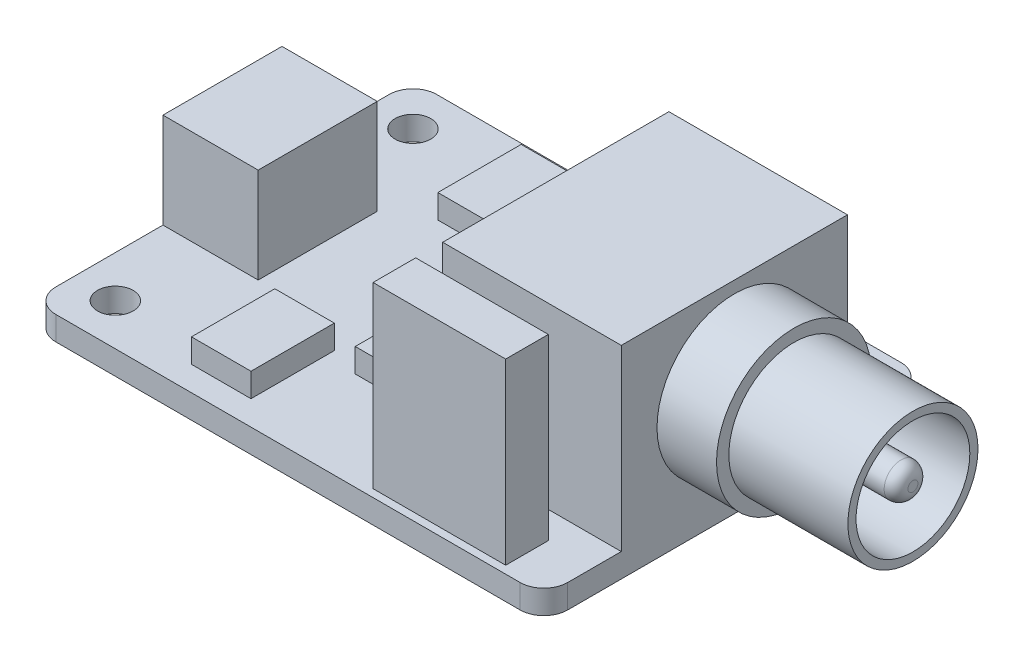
ISO-10303-21;
HEADER;
FILE_DESCRIPTION(('STEP AP214'),'2;1');
FILE_NAME('part.step','',(''),(''),'','','');
FILE_SCHEMA(('AUTOMOTIVE_DESIGN { 1 0 10303 214 1 1 1 1 }'));
ENDSEC;
DATA;
#1=APPLICATION_CONTEXT('core data for automotive mechanical design processes');
#2=APPLICATION_PROTOCOL_DEFINITION('international standard','automotive_design',2000,#1);
#3=PRODUCT_CONTEXT('',#1,'mechanical');
#4=PRODUCT('Part','Part','',(#3));
#5=PRODUCT_RELATED_PRODUCT_CATEGORY('part','',(#4));
#6=PRODUCT_DEFINITION_FORMATION('','',#4);
#7=PRODUCT_DEFINITION_CONTEXT('part definition',#1,'design');
#8=PRODUCT_DEFINITION('design','',#6,#7);
#9=PRODUCT_DEFINITION_SHAPE('','',#8);
#10=(LENGTH_UNIT() NAMED_UNIT(*) SI_UNIT(.MILLI.,.METRE.));
#11=(NAMED_UNIT(*) PLANE_ANGLE_UNIT() SI_UNIT($,.RADIAN.));
#12=(NAMED_UNIT(*) SI_UNIT($,.STERADIAN.) SOLID_ANGLE_UNIT());
#13=UNCERTAINTY_MEASURE_WITH_UNIT(LENGTH_MEASURE(1.E-05),#10,'distance_accuracy_value','');
#14=(GEOMETRIC_REPRESENTATION_CONTEXT(3) GLOBAL_UNCERTAINTY_ASSIGNED_CONTEXT((#13)) GLOBAL_UNIT_ASSIGNED_CONTEXT((#10,
#11,#12)) REPRESENTATION_CONTEXT('',''));
#15=CARTESIAN_POINT('',(0.,0.,0.));
#16=DIRECTION('',(0.,0.,1.));
#17=DIRECTION('',(1.,0.,0.));
#18=AXIS2_PLACEMENT_3D('',#15,#16,#17);
#19=CARTESIAN_POINT('',(0.,2.,0.));
#20=DIRECTION('',(0.,1.,0.));
#21=DIRECTION('',(0.,0.,1.));
#22=AXIS2_PLACEMENT_3D('',#19,#20,#21);
#23=PLANE('',#22);
#24=DIRECTION('',(0.,0.,1.));
#25=VECTOR('',#24,1.);
#26=CARTESIAN_POINT('',(-140.04992370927,2.,0.));
#27=LINE('',#26,#25);
#28=CARTESIAN_POINT('',(-140.04992370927,2.,-51.1604501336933));
#29=VERTEX_POINT('',#28);
#30=CARTESIAN_POINT('',(-140.04992370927,2.,-47.577668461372));
#31=VERTEX_POINT('',#30);
#32=EDGE_CURVE('E703',#29,#31,#27,.T.);
#33=ORIENTED_EDGE('',*,*,#32,.T.);
#34=DIRECTION('',(1.,0.,0.));
#35=VECTOR('',#34,1.);
#36=CARTESIAN_POINT('',(0.,2.,-47.577668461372));
#37=LINE('',#36,#35);
#38=CARTESIAN_POINT('',(-151.190476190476,2.,-47.577668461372));
#39=VERTEX_POINT('',#38);
#40=EDGE_CURVE('E708',#39,#31,#37,.T.);
#41=ORIENTED_EDGE('',*,*,#40,.F.);
#42=DIRECTION('',(0.,0.,1.));
#43=VECTOR('',#42,1.);
#44=CARTESIAN_POINT('',(-151.190476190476,2.,0.));
#45=LINE('',#44,#43);
#46=CARTESIAN_POINT('',(-151.190476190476,2.,-51.1604501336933));
#47=VERTEX_POINT('',#46);
#48=EDGE_CURVE('E721',#47,#39,#45,.T.);
#49=ORIENTED_EDGE('',*,*,#48,.F.);
#50=DIRECTION('',(1.,0.,0.));
#51=VECTOR('',#50,1.);
#52=CARTESIAN_POINT('',(0.,2.,-51.1604501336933));
#53=LINE('',#52,#51);
#54=EDGE_CURVE('E718',#47,#29,#53,.T.);
#55=ORIENTED_EDGE('',*,*,#54,.T.);
#56=EDGE_LOOP('',(#33,#41,#49,#55));
#57=FACE_BOUND('',#56,.T.);
#58=CARTESIAN_POINT('',(-175.690476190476,2.,-75.4285714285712));
#59=DIRECTION('',(0.,1.,0.));
#60=DIRECTION('',(0.,0.,1.));
#61=AXIS2_PLACEMENT_3D('',#58,#59,#60);
#62=CIRCLE('',#61,1.5);
#63=CARTESIAN_POINT('',(-175.690476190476,2.,-73.9285714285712));
#64=VERTEX_POINT('',#63);
#65=EDGE_CURVE('E768',#64,#64,#62,.T.);
#66=ORIENTED_EDGE('',*,*,#65,.F.);
#67=EDGE_LOOP('',(#66));
#68=FACE_BOUND('',#67,.T.);
#69=CARTESIAN_POINT('',(-175.690476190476,2.,-50.4285714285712));
#70=DIRECTION('',(0.,1.,0.));
#71=DIRECTION('',(0.,0.,1.));
#72=AXIS2_PLACEMENT_3D('',#69,#70,#71);
#73=CIRCLE('',#72,1.5);
#74=CARTESIAN_POINT('',(-175.690476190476,2.,-48.9285714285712));
#75=VERTEX_POINT('',#74);
#76=EDGE_CURVE('E762',#75,#75,#73,.T.);
#77=ORIENTED_EDGE('',*,*,#76,.F.);
#78=EDGE_LOOP('',(#77));
#79=FACE_BOUND('',#78,.T.);
#80=DIRECTION('',(0.,0.,1.));
#81=VECTOR('',#80,1.);
#82=CARTESIAN_POINT('',(-179.190476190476,2.,-78.9285714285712));
#83=LINE('',#82,#81);
#84=CARTESIAN_POINT('',(-179.190476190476,2.,-76.9285714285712));
#85=VERTEX_POINT('',#84);
#86=CARTESIAN_POINT('',(-179.190476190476,2.,-67.9285714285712));
#87=VERTEX_POINT('',#86);
#88=EDGE_CURVE('E774',#85,#87,#83,.T.);
#89=ORIENTED_EDGE('',*,*,#88,.T.);
#90=DIRECTION('',(-1.,0.,0.));
#91=VECTOR('',#90,1.);
#92=CARTESIAN_POINT('',(-171.190476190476,2.,-67.9285714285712));
#93=LINE('',#92,#91);
#94=CARTESIAN_POINT('',(-171.190476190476,2.,-67.9285714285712));
#95=VERTEX_POINT('',#94);
#96=EDGE_CURVE('E687',#95,#87,#93,.T.);
#97=ORIENTED_EDGE('',*,*,#96,.F.);
#98=DIRECTION('',(0.,0.,-1.));
#99=VECTOR('',#98,1.);
#100=CARTESIAN_POINT('',(-171.190476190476,2.,-57.9285714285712));
#101=LINE('',#100,#99);
#102=CARTESIAN_POINT('',(-171.190476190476,2.,-57.9285714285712));
#103=VERTEX_POINT('',#102);
#104=EDGE_CURVE('E673',#103,#95,#101,.T.);
#105=ORIENTED_EDGE('',*,*,#104,.F.);
#106=DIRECTION('',(1.,0.,0.));
#107=VECTOR('',#106,1.);
#108=CARTESIAN_POINT('',(-171.190476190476,2.,-57.9285714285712));
#109=LINE('',#108,#107);
#110=CARTESIAN_POINT('',(-179.190476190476,2.,-57.9285714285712));
#111=VERTEX_POINT('',#110);
#112=EDGE_CURVE('E678',#111,#103,#109,.T.);
#113=ORIENTED_EDGE('',*,*,#112,.F.);
#114=CARTESIAN_POINT('',(-179.190476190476,2.,-48.9285714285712));
#115=VERTEX_POINT('',#114);
#116=EDGE_CURVE('E777',#111,#115,#83,.T.);
#117=ORIENTED_EDGE('',*,*,#116,.T.);
#118=CARTESIAN_POINT('',(-177.190476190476,2.,-48.9285714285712));
#119=DIRECTION('',(0.,1.,0.));
#120=DIRECTION('',(0.,0.,1.));
#121=AXIS2_PLACEMENT_3D('',#118,#119,#120);
#122=CIRCLE('',#121,2.);
#123=CARTESIAN_POINT('',(-177.190476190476,2.,-46.9285714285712));
#124=VERTEX_POINT('',#123);
#125=EDGE_CURVE('E817',#115,#124,#122,.T.);
#126=ORIENTED_EDGE('',*,*,#125,.T.);
#127=DIRECTION('',(1.,0.,0.));
#128=VECTOR('',#127,1.);
#129=CARTESIAN_POINT('',(-179.190476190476,2.,-46.9285714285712));
#130=LINE('',#129,#128);
#131=CARTESIAN_POINT('',(-138.190476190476,2.,-46.9285714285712));
#132=VERTEX_POINT('',#131);
#133=EDGE_CURVE('E776',#124,#132,#130,.T.);
#134=ORIENTED_EDGE('',*,*,#133,.T.);
#135=CARTESIAN_POINT('',(-138.190476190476,2.,-48.9285714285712));
#136=DIRECTION('',(0.,1.,0.));
#137=DIRECTION('',(0.,0.,1.));
#138=AXIS2_PLACEMENT_3D('',#135,#136,#137);
#139=CIRCLE('',#138,2.);
#140=CARTESIAN_POINT('',(-136.190476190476,2.,-48.9285714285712));
#141=VERTEX_POINT('',#140);
#142=EDGE_CURVE('E819',#132,#141,#139,.T.);
#143=ORIENTED_EDGE('',*,*,#142,.T.);
#144=DIRECTION('',(0.,0.,-1.));
#145=VECTOR('',#144,1.);
#146=CARTESIAN_POINT('',(-136.190476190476,2.,-78.9285714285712));
#147=LINE('',#146,#145);
#148=CARTESIAN_POINT('',(-136.190476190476,2.,-53.4285714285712));
#149=VERTEX_POINT('',#148);
#150=EDGE_CURVE('E781',#141,#149,#147,.T.);
#151=ORIENTED_EDGE('',*,*,#150,.T.);
#152=DIRECTION('',(1.,0.,0.));
#153=VECTOR('',#152,1.);
#154=CARTESIAN_POINT('',(0.,2.,-53.4285714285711));
#155=LINE('',#154,#153);
#156=CARTESIAN_POINT('',(-151.190476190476,2.,-53.4285714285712));
#157=VERTEX_POINT('',#156);
#158=EDGE_CURVE('E738',#157,#149,#155,.T.);
#159=ORIENTED_EDGE('',*,*,#158,.F.);
#160=DIRECTION('',(0.,0.,-1.));
#161=VECTOR('',#160,1.);
#162=CARTESIAN_POINT('',(-151.190476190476,2.,0.));
#163=LINE('',#162,#161);
#164=CARTESIAN_POINT('',(-151.190476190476,2.,-72.4285714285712));
#165=VERTEX_POINT('',#164);
#166=EDGE_CURVE('E748',#157,#165,#163,.T.);
#167=ORIENTED_EDGE('',*,*,#166,.T.);
#168=DIRECTION('',(1.,0.,0.));
#169=VECTOR('',#168,1.);
#170=CARTESIAN_POINT('',(0.,2.,-72.4285714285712));
#171=LINE('',#170,#169);
#172=CARTESIAN_POINT('',(-136.190476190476,2.,-72.4285714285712));
#173=VERTEX_POINT('',#172);
#174=EDGE_CURVE('E733',#165,#173,#171,.T.);
#175=ORIENTED_EDGE('',*,*,#174,.T.);
#176=CARTESIAN_POINT('',(-136.190476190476,2.,-76.9285714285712));
#177=VERTEX_POINT('',#176);
#178=EDGE_CURVE('E780',#173,#177,#147,.T.);
#179=ORIENTED_EDGE('',*,*,#178,.T.);
#180=CARTESIAN_POINT('',(-138.190476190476,2.,-76.9285714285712));
#181=DIRECTION('',(0.,1.,0.));
#182=DIRECTION('',(0.,0.,1.));
#183=AXIS2_PLACEMENT_3D('',#180,#181,#182);
#184=CIRCLE('',#183,2.);
#185=CARTESIAN_POINT('',(-138.190476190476,2.,-78.9285714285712));
#186=VERTEX_POINT('',#185);
#187=EDGE_CURVE('E821',#177,#186,#184,.T.);
#188=ORIENTED_EDGE('',*,*,#187,.T.);
#189=DIRECTION('',(-1.,0.,0.));
#190=VECTOR('',#189,1.);
#191=CARTESIAN_POINT('',(-179.190476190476,2.,-78.9285714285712));
#192=LINE('',#191,#190);
#193=CARTESIAN_POINT('',(-177.190476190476,2.,-78.9285714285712));
#194=VERTEX_POINT('',#193);
#195=EDGE_CURVE('E784',#186,#194,#192,.T.);
#196=ORIENTED_EDGE('',*,*,#195,.T.);
#197=CARTESIAN_POINT('',(-177.190476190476,2.,-76.9285714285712));
#198=DIRECTION('',(0.,1.,0.));
#199=DIRECTION('',(0.,0.,1.));
#200=AXIS2_PLACEMENT_3D('',#197,#198,#199);
#201=CIRCLE('',#200,2.);
#202=EDGE_CURVE('E823',#194,#85,#201,.T.);
#203=ORIENTED_EDGE('',*,*,#202,.T.);
#204=EDGE_LOOP('',(#89,#97,#105,#113,#117,#126,#134,#143,#151,#159,#167,#175,#179,#188,#196,#203));
#205=FACE_BOUND('',#204,.T.);
#206=DIRECTION('',(-1.,0.,0.));
#207=VECTOR('',#206,1.);
#208=CARTESIAN_POINT('',(-155.281788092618,2.,-71.9845227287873));
#209=LINE('',#208,#207);
#210=CARTESIAN_POINT('',(-155.281788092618,2.,-71.9845227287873));
#211=VERTEX_POINT('',#210);
#212=CARTESIAN_POINT('',(-160.281788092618,2.,-71.9845227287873));
#213=VERTEX_POINT('',#212);
#214=EDGE_CURVE('E658',#211,#213,#209,.T.);
#215=ORIENTED_EDGE('',*,*,#214,.F.);
#216=DIRECTION('',(0.,0.,-1.));
#217=VECTOR('',#216,1.);
#218=CARTESIAN_POINT('',(-155.281788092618,2.,-71.9845227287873));
#219=LINE('',#218,#217);
#220=CARTESIAN_POINT('',(-155.281788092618,2.,-64.9845227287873));
#221=VERTEX_POINT('',#220);
#222=EDGE_CURVE('E644',#221,#211,#219,.T.);
#223=ORIENTED_EDGE('',*,*,#222,.F.);
#224=DIRECTION('',(1.,0.,0.));
#225=VECTOR('',#224,1.);
#226=CARTESIAN_POINT('',(-155.281788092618,2.,-64.9845227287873));
#227=LINE('',#226,#225);
#228=CARTESIAN_POINT('',(-160.281788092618,2.,-64.9845227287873));
#229=VERTEX_POINT('',#228);
#230=EDGE_CURVE('E649',#229,#221,#227,.T.);
#231=ORIENTED_EDGE('',*,*,#230,.F.);
#232=DIRECTION('',(0.,0.,1.));
#233=VECTOR('',#232,1.);
#234=CARTESIAN_POINT('',(-160.281788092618,2.,-71.9845227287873));
#235=LINE('',#234,#233);
#236=EDGE_CURVE('E660',#213,#229,#235,.T.);
#237=ORIENTED_EDGE('',*,*,#236,.F.);
#238=EDGE_LOOP('',(#215,#223,#231,#237));
#239=FACE_BOUND('',#238,.T.);
#240=DIRECTION('',(-1.,0.,0.));
#241=VECTOR('',#240,1.);
#242=CARTESIAN_POINT('',(-155.281788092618,2.,-62.1725170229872));
#243=LINE('',#242,#241);
#244=CARTESIAN_POINT('',(-155.281788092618,2.,-62.1725170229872));
#245=VERTEX_POINT('',#244);
#246=CARTESIAN_POINT('',(-160.281788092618,2.,-62.1725170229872));
#247=VERTEX_POINT('',#246);
#248=EDGE_CURVE('E629',#245,#247,#243,.T.);
#249=ORIENTED_EDGE('',*,*,#248,.F.);
#250=DIRECTION('',(0.,0.,-1.));
#251=VECTOR('',#250,1.);
#252=CARTESIAN_POINT('',(-155.281788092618,2.,-62.1725170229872));
#253=LINE('',#252,#251);
#254=CARTESIAN_POINT('',(-155.281788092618,2.,-55.1725170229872));
#255=VERTEX_POINT('',#254);
#256=EDGE_CURVE('E615',#255,#245,#253,.T.);
#257=ORIENTED_EDGE('',*,*,#256,.F.);
#258=DIRECTION('',(1.,0.,0.));
#259=VECTOR('',#258,1.);
#260=CARTESIAN_POINT('',(-155.281788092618,2.,-55.1725170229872));
#261=LINE('',#260,#259);
#262=CARTESIAN_POINT('',(-160.281788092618,2.,-55.1725170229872));
#263=VERTEX_POINT('',#262);
#264=EDGE_CURVE('E620',#263,#255,#261,.T.);
#265=ORIENTED_EDGE('',*,*,#264,.F.);
#266=DIRECTION('',(0.,0.,1.));
#267=VECTOR('',#266,1.);
#268=CARTESIAN_POINT('',(-160.281788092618,2.,-62.1725170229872));
#269=LINE('',#268,#267);
#270=EDGE_CURVE('E631',#247,#263,#269,.T.);
#271=ORIENTED_EDGE('',*,*,#270,.F.);
#272=EDGE_LOOP('',(#249,#257,#265,#271));
#273=FACE_BOUND('',#272,.T.);
#274=DIRECTION('',(-1.,0.,0.));
#275=VECTOR('',#274,1.);
#276=CARTESIAN_POINT('',(-163.012552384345,2.,-76.8417511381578));
#277=LINE('',#276,#275);
#278=CARTESIAN_POINT('',(-163.012552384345,2.,-76.8417511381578));
#279=VERTEX_POINT('',#278);
#280=CARTESIAN_POINT('',(-168.012552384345,2.,-76.8417511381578));
#281=VERTEX_POINT('',#280);
#282=EDGE_CURVE('E600',#279,#281,#277,.T.);
#283=ORIENTED_EDGE('',*,*,#282,.F.);
#284=DIRECTION('',(0.,0.,-1.));
#285=VECTOR('',#284,1.);
#286=CARTESIAN_POINT('',(-163.012552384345,2.,-76.8417511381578));
#287=LINE('',#286,#285);
#288=CARTESIAN_POINT('',(-163.012552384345,2.,-69.8417511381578));
#289=VERTEX_POINT('',#288);
#290=EDGE_CURVE('E586',#289,#279,#287,.T.);
#291=ORIENTED_EDGE('',*,*,#290,.F.);
#292=DIRECTION('',(1.,0.,0.));
#293=VECTOR('',#292,1.);
#294=CARTESIAN_POINT('',(-163.012552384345,2.,-69.8417511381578));
#295=LINE('',#294,#293);
#296=CARTESIAN_POINT('',(-168.012552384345,2.,-69.8417511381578));
#297=VERTEX_POINT('',#296);
#298=EDGE_CURVE('E591',#297,#289,#295,.T.);
#299=ORIENTED_EDGE('',*,*,#298,.F.);
#300=DIRECTION('',(0.,0.,1.));
#301=VECTOR('',#300,1.);
#302=CARTESIAN_POINT('',(-168.012552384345,2.,-76.8417511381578));
#303=LINE('',#302,#301);
#304=EDGE_CURVE('E602',#281,#297,#303,.T.);
#305=ORIENTED_EDGE('',*,*,#304,.F.);
#306=EDGE_LOOP('',(#283,#291,#299,#305));
#307=FACE_BOUND('',#306,.T.);
#308=DIRECTION('',(-1.,0.,0.));
#309=VECTOR('',#308,1.);
#310=CARTESIAN_POINT('',(-162.861321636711,2.,-55.9958820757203));
#311=LINE('',#310,#309);
#312=CARTESIAN_POINT('',(-162.861321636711,2.,-55.9958820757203));
#313=VERTEX_POINT('',#312);
#314=CARTESIAN_POINT('',(-167.861321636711,2.,-55.9958820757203));
#315=VERTEX_POINT('',#314);
#316=EDGE_CURVE('E571',#313,#315,#311,.T.);
#317=ORIENTED_EDGE('',*,*,#316,.F.);
#318=DIRECTION('',(0.,0.,-1.));
#319=VECTOR('',#318,1.);
#320=CARTESIAN_POINT('',(-162.861321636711,2.,-55.9958820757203));
#321=LINE('',#320,#319);
#322=CARTESIAN_POINT('',(-162.861321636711,2.,-48.9958820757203));
#323=VERTEX_POINT('',#322);
#324=EDGE_CURVE('E551',#323,#313,#321,.T.);
#325=ORIENTED_EDGE('',*,*,#324,.F.);
#326=DIRECTION('',(1.,0.,0.));
#327=VECTOR('',#326,1.);
#328=CARTESIAN_POINT('',(-162.861321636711,2.,-48.9958820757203));
#329=LINE('',#328,#327);
#330=CARTESIAN_POINT('',(-167.861321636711,2.,-48.9958820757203));
#331=VERTEX_POINT('',#330);
#332=EDGE_CURVE('E562',#331,#323,#329,.T.);
#333=ORIENTED_EDGE('',*,*,#332,.F.);
#334=DIRECTION('',(0.,0.,1.));
#335=VECTOR('',#334,1.);
#336=CARTESIAN_POINT('',(-167.861321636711,2.,-55.9958820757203));
#337=LINE('',#336,#335);
#338=EDGE_CURVE('E573',#315,#331,#337,.T.);
#339=ORIENTED_EDGE('',*,*,#338,.F.);
#340=EDGE_LOOP('',(#317,#325,#333,#339));
#341=FACE_BOUND('',#340,.T.);
#342=ADVANCED_FACE('F35',(#57,#68,#79,#205,#239,#273,#307,#341),#23,.T.);
#343=CARTESIAN_POINT('',(0.,0.,0.));
#344=DIRECTION('',(0.,1.,0.));
#345=DIRECTION('',(0.,0.,1.));
#346=AXIS2_PLACEMENT_3D('',#343,#344,#345);
#347=PLANE('',#346);
#348=DIRECTION('',(0.,0.,1.));
#349=VECTOR('',#348,1.);
#350=CARTESIAN_POINT('',(-179.190476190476,0.,-78.9285714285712));
#351=LINE('',#350,#349);
#352=CARTESIAN_POINT('',(-179.190476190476,0.,-76.9285714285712));
#353=VERTEX_POINT('',#352);
#354=CARTESIAN_POINT('',(-179.190476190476,0.,-48.9285714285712));
#355=VERTEX_POINT('',#354);
#356=EDGE_CURVE('E771',#353,#355,#351,.T.);
#357=ORIENTED_EDGE('',*,*,#356,.F.);
#358=CARTESIAN_POINT('',(-177.190476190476,0.,-76.9285714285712));
#359=DIRECTION('',(0.,1.,0.));
#360=DIRECTION('',(0.,0.,1.));
#361=AXIS2_PLACEMENT_3D('',#358,#359,#360);
#362=CIRCLE('',#361,2.);
#363=CARTESIAN_POINT('',(-177.190476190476,0.,-78.9285714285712));
#364=VERTEX_POINT('',#363);
#365=EDGE_CURVE('E810',#353,#364,#362,.F.);
#366=ORIENTED_EDGE('',*,*,#365,.T.);
#367=DIRECTION('',(-1.,0.,0.));
#368=VECTOR('',#367,1.);
#369=CARTESIAN_POINT('',(-179.190476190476,0.,-78.9285714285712));
#370=LINE('',#369,#368);
#371=CARTESIAN_POINT('',(-138.190476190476,0.,-78.9285714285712));
#372=VERTEX_POINT('',#371);
#373=EDGE_CURVE('E796',#372,#364,#370,.T.);
#374=ORIENTED_EDGE('',*,*,#373,.F.);
#375=CARTESIAN_POINT('',(-138.190476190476,0.,-76.9285714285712));
#376=DIRECTION('',(0.,1.,0.));
#377=DIRECTION('',(0.,0.,1.));
#378=AXIS2_PLACEMENT_3D('',#375,#376,#377);
#379=CIRCLE('',#378,2.);
#380=CARTESIAN_POINT('',(-136.190476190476,0.,-76.9285714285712));
#381=VERTEX_POINT('',#380);
#382=EDGE_CURVE('E808',#372,#381,#379,.F.);
#383=ORIENTED_EDGE('',*,*,#382,.T.);
#384=DIRECTION('',(0.,0.,-1.));
#385=VECTOR('',#384,1.);
#386=CARTESIAN_POINT('',(-136.190476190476,0.,-78.9285714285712));
#387=LINE('',#386,#385);
#388=CARTESIAN_POINT('',(-136.190476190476,0.,-48.9285714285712));
#389=VERTEX_POINT('',#388);
#390=EDGE_CURVE('E793',#389,#381,#387,.T.);
#391=ORIENTED_EDGE('',*,*,#390,.F.);
#392=CARTESIAN_POINT('',(-138.190476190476,0.,-48.9285714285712));
#393=DIRECTION('',(0.,1.,0.));
#394=DIRECTION('',(0.,0.,1.));
#395=AXIS2_PLACEMENT_3D('',#392,#393,#394);
#396=CIRCLE('',#395,2.);
#397=CARTESIAN_POINT('',(-138.190476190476,0.,-46.9285714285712));
#398=VERTEX_POINT('',#397);
#399=EDGE_CURVE('E806',#389,#398,#396,.F.);
#400=ORIENTED_EDGE('',*,*,#399,.T.);
#401=DIRECTION('',(1.,0.,0.));
#402=VECTOR('',#401,1.);
#403=CARTESIAN_POINT('',(-179.190476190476,0.,-46.9285714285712));
#404=LINE('',#403,#402);
#405=CARTESIAN_POINT('',(-177.190476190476,0.,-46.9285714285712));
#406=VERTEX_POINT('',#405);
#407=EDGE_CURVE('E790',#406,#398,#404,.T.);
#408=ORIENTED_EDGE('',*,*,#407,.F.);
#409=CARTESIAN_POINT('',(-177.190476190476,0.,-48.9285714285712));
#410=DIRECTION('',(0.,1.,0.));
#411=DIRECTION('',(0.,0.,1.));
#412=AXIS2_PLACEMENT_3D('',#409,#410,#411);
#413=CIRCLE('',#412,2.);
#414=EDGE_CURVE('E804',#406,#355,#413,.F.);
#415=ORIENTED_EDGE('',*,*,#414,.T.);
#416=EDGE_LOOP('',(#357,#366,#374,#383,#391,#400,#408,#415));
#417=FACE_BOUND('',#416,.T.);
#418=CARTESIAN_POINT('',(-175.690476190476,0.,-75.4285714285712));
#419=DIRECTION('',(0.,1.,0.));
#420=DIRECTION('',(0.,0.,1.));
#421=AXIS2_PLACEMENT_3D('',#418,#419,#420);
#422=CIRCLE('',#421,1.5);
#423=CARTESIAN_POINT('',(-175.690476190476,0.,-73.9285714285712));
#424=VERTEX_POINT('',#423);
#425=EDGE_CURVE('E765',#424,#424,#422,.T.);
#426=ORIENTED_EDGE('',*,*,#425,.T.);
#427=EDGE_LOOP('',(#426));
#428=FACE_BOUND('',#427,.T.);
#429=CARTESIAN_POINT('',(-175.690476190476,0.,-50.4285714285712));
#430=DIRECTION('',(0.,1.,0.));
#431=DIRECTION('',(0.,0.,1.));
#432=AXIS2_PLACEMENT_3D('',#429,#430,#431);
#433=CIRCLE('',#432,1.5);
#434=CARTESIAN_POINT('',(-175.690476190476,0.,-48.9285714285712));
#435=VERTEX_POINT('',#434);
#436=EDGE_CURVE('E761',#435,#435,#433,.T.);
#437=ORIENTED_EDGE('',*,*,#436,.T.);
#438=EDGE_LOOP('',(#437));
#439=FACE_BOUND('',#438,.T.);
#440=ADVANCED_FACE('F954',(#417,#428,#439),#347,.F.);
#441=CARTESIAN_POINT('',(-179.190476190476,2.,-78.9285714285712));
#442=DIRECTION('',(1.,0.,0.));
#443=DIRECTION('',(0.,0.,-1.));
#444=AXIS2_PLACEMENT_3D('',#441,#442,#443);
#445=PLANE('',#444);
#446=DIRECTION('',(0.,0.,1.));
#447=VECTOR('',#446,1.);
#448=CARTESIAN_POINT('',(-179.190476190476,3.,-66.9285714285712));
#449=LINE('',#448,#447);
#450=CARTESIAN_POINT('',(-179.190476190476,3.,-66.9285714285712));
#451=VERTEX_POINT('',#450);
#452=CARTESIAN_POINT('',(-179.190476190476,3.,-58.9285714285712));
#453=VERTEX_POINT('',#452);
#454=EDGE_CURVE('E541',#451,#453,#449,.T.);
#455=ORIENTED_EDGE('',*,*,#454,.F.);
#456=DIRECTION('',(0.,-1.,0.));
#457=VECTOR('',#456,1.);
#458=CARTESIAN_POINT('',(-179.190476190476,9.,-66.9285714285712));
#459=LINE('',#458,#457);
#460=CARTESIAN_POINT('',(-179.190476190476,9.,-66.9285714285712));
#461=VERTEX_POINT('',#460);
#462=EDGE_CURVE('E517',#461,#451,#459,.T.);
#463=ORIENTED_EDGE('',*,*,#462,.F.);
#464=DIRECTION('',(0.,0.,-1.));
#465=VECTOR('',#464,1.);
#466=CARTESIAN_POINT('',(-179.190476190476,9.,-66.9285714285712));
#467=LINE('',#466,#465);
#468=CARTESIAN_POINT('',(-179.190476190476,9.,-58.9285714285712));
#469=VERTEX_POINT('',#468);
#470=EDGE_CURVE('E530',#469,#461,#467,.T.);
#471=ORIENTED_EDGE('',*,*,#470,.F.);
#472=DIRECTION('',(0.,1.,0.));
#473=VECTOR('',#472,1.);
#474=CARTESIAN_POINT('',(-179.190476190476,9.,-58.9285714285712));
#475=LINE('',#474,#473);
#476=EDGE_CURVE('E544',#453,#469,#475,.T.);
#477=ORIENTED_EDGE('',*,*,#476,.F.);
#478=EDGE_LOOP('',(#455,#463,#471,#477));
#479=FACE_BOUND('',#478,.T.);
#480=ORIENTED_EDGE('',*,*,#88,.F.);
#481=DIRECTION('',(0.,-1.,0.));
#482=VECTOR('',#481,1.);
#483=CARTESIAN_POINT('',(-179.190476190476,2.,-76.9285714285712));
#484=LINE('',#483,#482);
#485=EDGE_CURVE('E801',#85,#353,#484,.T.);
#486=ORIENTED_EDGE('',*,*,#485,.T.);
#487=ORIENTED_EDGE('',*,*,#356,.T.);
#488=DIRECTION('',(0.,-1.,0.));
#489=VECTOR('',#488,1.);
#490=CARTESIAN_POINT('',(-179.190476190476,2.,-48.9285714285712));
#491=LINE('',#490,#489);
#492=EDGE_CURVE('E787',#355,#115,#491,.F.);
#493=ORIENTED_EDGE('',*,*,#492,.T.);
#494=ORIENTED_EDGE('',*,*,#116,.F.);
#495=DIRECTION('',(0.,-1.,0.));
#496=VECTOR('',#495,1.);
#497=CARTESIAN_POINT('',(-179.190476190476,10.,-57.9285714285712));
#498=LINE('',#497,#496);
#499=CARTESIAN_POINT('',(-179.190476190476,10.,-57.9285714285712));
#500=VERTEX_POINT('',#499);
#501=EDGE_CURVE('E694',#500,#111,#498,.T.);
#502=ORIENTED_EDGE('',*,*,#501,.F.);
#503=DIRECTION('',(0.,0.,1.));
#504=VECTOR('',#503,1.);
#505=CARTESIAN_POINT('',(-179.190476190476,10.,-57.9285714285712));
#506=LINE('',#505,#504);
#507=CARTESIAN_POINT('',(-179.190476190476,10.,-67.9285714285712));
#508=VERTEX_POINT('',#507);
#509=EDGE_CURVE('E680',#508,#500,#506,.T.);
#510=ORIENTED_EDGE('',*,*,#509,.F.);
#511=DIRECTION('',(0.,-1.,0.));
#512=VECTOR('',#511,1.);
#513=CARTESIAN_POINT('',(-179.190476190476,10.,-67.9285714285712));
#514=LINE('',#513,#512);
#515=EDGE_CURVE('E697',#508,#87,#514,.T.);
#516=ORIENTED_EDGE('',*,*,#515,.T.);
#517=EDGE_LOOP('',(#480,#486,#487,#493,#494,#502,#510,#516));
#518=FACE_BOUND('',#517,.T.);
#519=ADVANCED_FACE('F960',(#479,#518),#445,.F.);
#520=CARTESIAN_POINT('',(-179.190476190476,2.,-46.9285714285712));
#521=DIRECTION('',(0.,0.,-1.));
#522=DIRECTION('',(-1.,0.,0.));
#523=AXIS2_PLACEMENT_3D('',#520,#521,#522);
#524=PLANE('',#523);
#525=ORIENTED_EDGE('',*,*,#407,.T.);
#526=DIRECTION('',(0.,-1.,0.));
#527=VECTOR('',#526,1.);
#528=CARTESIAN_POINT('',(-138.190476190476,2.,-46.9285714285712));
#529=LINE('',#528,#527);
#530=EDGE_CURVE('E834',#398,#132,#529,.F.);
#531=ORIENTED_EDGE('',*,*,#530,.T.);
#532=ORIENTED_EDGE('',*,*,#133,.F.);
#533=DIRECTION('',(0.,-1.,0.));
#534=VECTOR('',#533,1.);
#535=CARTESIAN_POINT('',(-177.190476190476,2.,-46.9285714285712));
#536=LINE('',#535,#534);
#537=EDGE_CURVE('E831',#124,#406,#536,.T.);
#538=ORIENTED_EDGE('',*,*,#537,.T.);
#539=EDGE_LOOP('',(#525,#531,#532,#538));
#540=FACE_BOUND('',#539,.T.);
#541=ADVANCED_FACE('F975',(#540),#524,.F.);
#542=CARTESIAN_POINT('',(-136.190476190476,2.,-78.9285714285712));
#543=DIRECTION('',(-1.,0.,0.));
#544=DIRECTION('',(0.,0.,1.));
#545=AXIS2_PLACEMENT_3D('',#542,#543,#544);
#546=PLANE('',#545);
#547=CARTESIAN_POINT('',(-136.190476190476,9.5,-62.9285714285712));
#548=DIRECTION('',(-1.,0.,0.));
#549=DIRECTION('',(0.,0.,1.));
#550=AXIS2_PLACEMENT_3D('',#547,#548,#549);
#551=CIRCLE('',#550,6.5);
#552=CARTESIAN_POINT('',(-136.190476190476,9.5,-56.4285714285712));
#553=VERTEX_POINT('',#552);
#554=EDGE_CURVE('E910',#553,#553,#551,.F.);
#555=ORIENTED_EDGE('',*,*,#554,.F.);
#556=EDGE_LOOP('',(#555));
#557=FACE_BOUND('',#556,.T.);
#558=ORIENTED_EDGE('',*,*,#390,.T.);
#559=DIRECTION('',(0.,-1.,0.));
#560=VECTOR('',#559,1.);
#561=CARTESIAN_POINT('',(-136.190476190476,2.,-76.9285714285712));
#562=LINE('',#561,#560);
#563=EDGE_CURVE('E828',#381,#177,#562,.F.);
#564=ORIENTED_EDGE('',*,*,#563,.T.);
#565=ORIENTED_EDGE('',*,*,#178,.F.);
#566=DIRECTION('',(0.,-1.,0.));
#567=VECTOR('',#566,1.);
#568=CARTESIAN_POINT('',(-136.190476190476,17.,-72.4285714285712));
#569=LINE('',#568,#567);
#570=CARTESIAN_POINT('',(-136.190476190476,17.,-72.4285714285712));
#571=VERTEX_POINT('',#570);
#572=EDGE_CURVE('E745',#571,#173,#569,.T.);
#573=ORIENTED_EDGE('',*,*,#572,.F.);
#574=DIRECTION('',(0.,0.,-1.));
#575=VECTOR('',#574,1.);
#576=CARTESIAN_POINT('',(-136.190476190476,17.,0.));
#577=LINE('',#576,#575);
#578=CARTESIAN_POINT('',(-136.190476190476,17.,-53.4285714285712));
#579=VERTEX_POINT('',#578);
#580=EDGE_CURVE('E743',#579,#571,#577,.T.);
#581=ORIENTED_EDGE('',*,*,#580,.F.);
#582=DIRECTION('',(0.,-1.,0.));
#583=VECTOR('',#582,1.);
#584=CARTESIAN_POINT('',(-136.190476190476,17.,-53.4285714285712));
#585=LINE('',#584,#583);
#586=EDGE_CURVE('E753',#579,#149,#585,.T.);
#587=ORIENTED_EDGE('',*,*,#586,.T.);
#588=ORIENTED_EDGE('',*,*,#150,.F.);
#589=DIRECTION('',(0.,-1.,0.));
#590=VECTOR('',#589,1.);
#591=CARTESIAN_POINT('',(-136.190476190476,2.,-48.9285714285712));
#592=LINE('',#591,#590);
#593=EDGE_CURVE('E825',#141,#389,#592,.T.);
#594=ORIENTED_EDGE('',*,*,#593,.T.);
#595=EDGE_LOOP('',(#558,#564,#565,#573,#581,#587,#588,#594));
#596=FACE_BOUND('',#595,.T.);
#597=ADVANCED_FACE('F971',(#557,#596),#546,.F.);
#598=CARTESIAN_POINT('',(-179.190476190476,2.,-78.9285714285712));
#599=DIRECTION('',(0.,0.,1.));
#600=DIRECTION('',(1.,0.,0.));
#601=AXIS2_PLACEMENT_3D('',#598,#599,#600);
#602=PLANE('',#601);
#603=ORIENTED_EDGE('',*,*,#373,.T.);
#604=DIRECTION('',(0.,-1.,0.));
#605=VECTOR('',#604,1.);
#606=CARTESIAN_POINT('',(-177.190476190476,2.,-78.9285714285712));
#607=LINE('',#606,#605);
#608=EDGE_CURVE('E815',#364,#194,#607,.F.);
#609=ORIENTED_EDGE('',*,*,#608,.T.);
#610=ORIENTED_EDGE('',*,*,#195,.F.);
#611=DIRECTION('',(0.,-1.,0.));
#612=VECTOR('',#611,1.);
#613=CARTESIAN_POINT('',(-138.190476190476,2.,-78.9285714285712));
#614=LINE('',#613,#612);
#615=EDGE_CURVE('E812',#186,#372,#614,.T.);
#616=ORIENTED_EDGE('',*,*,#615,.T.);
#617=EDGE_LOOP('',(#603,#609,#610,#616));
#618=FACE_BOUND('',#617,.T.);
#619=ADVANCED_FACE('F968',(#618),#602,.F.);
#620=CARTESIAN_POINT('',(-175.690476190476,2.,-75.4285714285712));
#621=DIRECTION('',(0.,-1.,0.));
#622=DIRECTION('',(0.,0.,-1.));
#623=AXIS2_PLACEMENT_3D('',#620,#621,#622);
#624=CYLINDRICAL_SURFACE('',#623,1.5);
#625=ORIENTED_EDGE('',*,*,#65,.T.);
#626=EDGE_LOOP('',(#625));
#627=FACE_BOUND('',#626,.T.);
#628=ORIENTED_EDGE('',*,*,#425,.F.);
#629=EDGE_LOOP('',(#628));
#630=FACE_BOUND('',#629,.T.);
#631=ADVANCED_FACE('F965',(#627,#630),#624,.F.);
#632=CARTESIAN_POINT('',(-175.690476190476,2.,-50.4285714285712));
#633=DIRECTION('',(0.,-1.,0.));
#634=DIRECTION('',(0.,0.,-1.));
#635=AXIS2_PLACEMENT_3D('',#632,#633,#634);
#636=CYLINDRICAL_SURFACE('',#635,1.5);
#637=ORIENTED_EDGE('',*,*,#76,.T.);
#638=EDGE_LOOP('',(#637));
#639=FACE_BOUND('',#638,.T.);
#640=ORIENTED_EDGE('',*,*,#436,.F.);
#641=EDGE_LOOP('',(#640));
#642=FACE_BOUND('',#641,.T.);
#643=ADVANCED_FACE('F987',(#639,#642),#636,.F.);
#644=CARTESIAN_POINT('',(-177.190476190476,2.,-76.9285714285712));
#645=DIRECTION('',(0.,-1.,0.));
#646=DIRECTION('',(0.,0.,-1.));
#647=AXIS2_PLACEMENT_3D('',#644,#645,#646);
#648=CYLINDRICAL_SURFACE('',#647,2.);
#649=ORIENTED_EDGE('',*,*,#202,.F.);
#650=ORIENTED_EDGE('',*,*,#608,.F.);
#651=ORIENTED_EDGE('',*,*,#365,.F.);
#652=ORIENTED_EDGE('',*,*,#485,.F.);
#653=EDGE_LOOP('',(#649,#650,#651,#652));
#654=FACE_BOUND('',#653,.T.);
#655=ADVANCED_FACE('F983',(#654),#648,.T.);
#656=CARTESIAN_POINT('',(-138.190476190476,2.,-76.9285714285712));
#657=DIRECTION('',(0.,-1.,0.));
#658=DIRECTION('',(0.,0.,-1.));
#659=AXIS2_PLACEMENT_3D('',#656,#657,#658);
#660=CYLINDRICAL_SURFACE('',#659,2.);
#661=ORIENTED_EDGE('',*,*,#187,.F.);
#662=ORIENTED_EDGE('',*,*,#563,.F.);
#663=ORIENTED_EDGE('',*,*,#382,.F.);
#664=ORIENTED_EDGE('',*,*,#615,.F.);
#665=EDGE_LOOP('',(#661,#662,#663,#664));
#666=FACE_BOUND('',#665,.T.);
#667=ADVANCED_FACE('F986',(#666),#660,.T.);
#668=CARTESIAN_POINT('',(-138.190476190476,2.,-48.9285714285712));
#669=DIRECTION('',(0.,-1.,0.));
#670=DIRECTION('',(0.,0.,-1.));
#671=AXIS2_PLACEMENT_3D('',#668,#669,#670);
#672=CYLINDRICAL_SURFACE('',#671,2.);
#673=ORIENTED_EDGE('',*,*,#142,.F.);
#674=ORIENTED_EDGE('',*,*,#530,.F.);
#675=ORIENTED_EDGE('',*,*,#399,.F.);
#676=ORIENTED_EDGE('',*,*,#593,.F.);
#677=EDGE_LOOP('',(#673,#674,#675,#676));
#678=FACE_BOUND('',#677,.T.);
#679=ADVANCED_FACE('F991',(#678),#672,.T.);
#680=CARTESIAN_POINT('',(-177.190476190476,2.,-48.9285714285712));
#681=DIRECTION('',(0.,-1.,0.));
#682=DIRECTION('',(0.,0.,-1.));
#683=AXIS2_PLACEMENT_3D('',#680,#681,#682);
#684=CYLINDRICAL_SURFACE('',#683,2.);
#685=ORIENTED_EDGE('',*,*,#125,.F.);
#686=ORIENTED_EDGE('',*,*,#492,.F.);
#687=ORIENTED_EDGE('',*,*,#414,.F.);
#688=ORIENTED_EDGE('',*,*,#537,.F.);
#689=EDGE_LOOP('',(#685,#686,#687,#688));
#690=FACE_BOUND('',#689,.T.);
#691=ADVANCED_FACE('F995',(#690),#684,.T.);
#692=CARTESIAN_POINT('',(0.,17.,-72.4285714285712));
#693=DIRECTION('',(0.,0.,-1.));
#694=DIRECTION('',(-1.,0.,0.));
#695=AXIS2_PLACEMENT_3D('',#692,#693,#694);
#696=PLANE('',#695);
#697=ORIENTED_EDGE('',*,*,#174,.F.);
#698=DIRECTION('',(0.,-1.,0.));
#699=VECTOR('',#698,1.);
#700=CARTESIAN_POINT('',(-151.190476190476,17.,-72.4285714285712));
#701=LINE('',#700,#699);
#702=CARTESIAN_POINT('',(-151.190476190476,17.,-72.4285714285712));
#703=VERTEX_POINT('',#702);
#704=EDGE_CURVE('E758',#703,#165,#701,.T.);
#705=ORIENTED_EDGE('',*,*,#704,.F.);
#706=DIRECTION('',(1.,0.,0.));
#707=VECTOR('',#706,1.);
#708=CARTESIAN_POINT('',(0.,17.,-72.4285714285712));
#709=LINE('',#708,#707);
#710=EDGE_CURVE('E734',#703,#571,#709,.T.);
#711=ORIENTED_EDGE('',*,*,#710,.T.);
#712=ORIENTED_EDGE('',*,*,#572,.T.);
#713=EDGE_LOOP('',(#697,#705,#711,#712));
#714=FACE_BOUND('',#713,.T.);
#715=ADVANCED_FACE('F999',(#714),#696,.T.);
#716=CARTESIAN_POINT('',(-151.190476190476,17.,0.));
#717=DIRECTION('',(-1.,0.,0.));
#718=DIRECTION('',(0.,0.,1.));
#719=AXIS2_PLACEMENT_3D('',#716,#717,#718);
#720=PLANE('',#719);
#721=ORIENTED_EDGE('',*,*,#166,.F.);
#722=DIRECTION('',(0.,-1.,0.));
#723=VECTOR('',#722,1.);
#724=CARTESIAN_POINT('',(-151.190476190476,17.,-53.4285714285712));
#725=LINE('',#724,#723);
#726=CARTESIAN_POINT('',(-151.190476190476,17.,-53.4285714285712));
#727=VERTEX_POINT('',#726);
#728=EDGE_CURVE('E756',#727,#157,#725,.T.);
#729=ORIENTED_EDGE('',*,*,#728,.F.);
#730=DIRECTION('',(0.,0.,-1.));
#731=VECTOR('',#730,1.);
#732=CARTESIAN_POINT('',(-151.190476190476,17.,0.));
#733=LINE('',#732,#731);
#734=EDGE_CURVE('E737',#727,#703,#733,.T.);
#735=ORIENTED_EDGE('',*,*,#734,.T.);
#736=ORIENTED_EDGE('',*,*,#704,.T.);
#737=EDGE_LOOP('',(#721,#729,#735,#736));
#738=FACE_BOUND('',#737,.T.);
#739=ADVANCED_FACE('F1232',(#738),#720,.T.);
#740=CARTESIAN_POINT('',(0.,17.,-53.4285714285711));
#741=DIRECTION('',(0.,0.,-1.));
#742=DIRECTION('',(-1.,0.,0.));
#743=AXIS2_PLACEMENT_3D('',#740,#741,#742);
#744=PLANE('',#743);
#745=ORIENTED_EDGE('',*,*,#158,.T.);
#746=ORIENTED_EDGE('',*,*,#586,.F.);
#747=DIRECTION('',(1.,0.,0.));
#748=VECTOR('',#747,1.);
#749=CARTESIAN_POINT('',(0.,17.,-53.4285714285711));
#750=LINE('',#749,#748);
#751=EDGE_CURVE('E741',#727,#579,#750,.T.);
#752=ORIENTED_EDGE('',*,*,#751,.F.);
#753=ORIENTED_EDGE('',*,*,#728,.T.);
#754=EDGE_LOOP('',(#745,#746,#752,#753));
#755=FACE_BOUND('',#754,.T.);
#756=ADVANCED_FACE('F1228',(#755),#744,.F.);
#757=CARTESIAN_POINT('',(0.,17.,0.));
#758=DIRECTION('',(0.,1.,0.));
#759=DIRECTION('',(0.,0.,1.));
#760=AXIS2_PLACEMENT_3D('',#757,#758,#759);
#761=PLANE('',#760);
#762=ORIENTED_EDGE('',*,*,#710,.F.);
#763=ORIENTED_EDGE('',*,*,#734,.F.);
#764=ORIENTED_EDGE('',*,*,#751,.T.);
#765=ORIENTED_EDGE('',*,*,#580,.T.);
#766=EDGE_LOOP('',(#762,#763,#764,#765));
#767=FACE_BOUND('',#766,.T.);
#768=ADVANCED_FACE('F1224',(#767),#761,.T.);
#769=CARTESIAN_POINT('',(-140.04992370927,17.,0.));
#770=DIRECTION('',(1.,0.,0.));
#771=DIRECTION('',(0.,0.,-1.));
#772=AXIS2_PLACEMENT_3D('',#769,#770,#771);
#773=PLANE('',#772);
#774=ORIENTED_EDGE('',*,*,#32,.F.);
#775=DIRECTION('',(0.,-1.,0.));
#776=VECTOR('',#775,1.);
#777=CARTESIAN_POINT('',(-140.04992370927,17.,-51.1604501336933));
#778=LINE('',#777,#776);
#779=CARTESIAN_POINT('',(-140.04992370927,17.,-51.1604501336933));
#780=VERTEX_POINT('',#779);
#781=EDGE_CURVE('E731',#780,#29,#778,.T.);
#782=ORIENTED_EDGE('',*,*,#781,.F.);
#783=DIRECTION('',(0.,0.,1.));
#784=VECTOR('',#783,1.);
#785=CARTESIAN_POINT('',(-140.04992370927,17.,0.));
#786=LINE('',#785,#784);
#787=CARTESIAN_POINT('',(-140.04992370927,17.,-47.577668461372));
#788=VERTEX_POINT('',#787);
#789=EDGE_CURVE('E704',#780,#788,#786,.T.);
#790=ORIENTED_EDGE('',*,*,#789,.T.);
#791=DIRECTION('',(0.,-1.,0.));
#792=VECTOR('',#791,1.);
#793=CARTESIAN_POINT('',(-140.04992370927,17.,-47.577668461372));
#794=LINE('',#793,#792);
#795=EDGE_CURVE('E715',#788,#31,#794,.T.);
#796=ORIENTED_EDGE('',*,*,#795,.T.);
#797=EDGE_LOOP('',(#774,#782,#790,#796));
#798=FACE_BOUND('',#797,.T.);
#799=ADVANCED_FACE('F1220',(#798),#773,.T.);
#800=CARTESIAN_POINT('',(0.,17.,-51.1604501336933));
#801=DIRECTION('',(0.,0.,-1.));
#802=DIRECTION('',(-1.,0.,0.));
#803=AXIS2_PLACEMENT_3D('',#800,#801,#802);
#804=PLANE('',#803);
#805=ORIENTED_EDGE('',*,*,#54,.F.);
#806=DIRECTION('',(0.,-1.,0.));
#807=VECTOR('',#806,1.);
#808=CARTESIAN_POINT('',(-151.190476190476,17.,-51.1604501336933));
#809=LINE('',#808,#807);
#810=CARTESIAN_POINT('',(-151.190476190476,17.,-51.1604501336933));
#811=VERTEX_POINT('',#810);
#812=EDGE_CURVE('E729',#811,#47,#809,.T.);
#813=ORIENTED_EDGE('',*,*,#812,.F.);
#814=DIRECTION('',(1.,0.,0.));
#815=VECTOR('',#814,1.);
#816=CARTESIAN_POINT('',(0.,17.,-51.1604501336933));
#817=LINE('',#816,#815);
#818=EDGE_CURVE('E707',#811,#780,#817,.T.);
#819=ORIENTED_EDGE('',*,*,#818,.T.);
#820=ORIENTED_EDGE('',*,*,#781,.T.);
#821=EDGE_LOOP('',(#805,#813,#819,#820));
#822=FACE_BOUND('',#821,.T.);
#823=ADVANCED_FACE('F1216',(#822),#804,.T.);
#824=CARTESIAN_POINT('',(-151.190476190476,17.,0.));
#825=DIRECTION('',(1.,0.,0.));
#826=DIRECTION('',(0.,0.,-1.));
#827=AXIS2_PLACEMENT_3D('',#824,#825,#826);
#828=PLANE('',#827);
#829=ORIENTED_EDGE('',*,*,#48,.T.);
#830=DIRECTION('',(0.,-1.,0.));
#831=VECTOR('',#830,1.);
#832=CARTESIAN_POINT('',(-151.190476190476,17.,-47.577668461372));
#833=LINE('',#832,#831);
#834=CARTESIAN_POINT('',(-151.190476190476,17.,-47.577668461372));
#835=VERTEX_POINT('',#834);
#836=EDGE_CURVE('E727',#835,#39,#833,.T.);
#837=ORIENTED_EDGE('',*,*,#836,.F.);
#838=DIRECTION('',(0.,0.,1.));
#839=VECTOR('',#838,1.);
#840=CARTESIAN_POINT('',(-151.190476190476,17.,0.));
#841=LINE('',#840,#839);
#842=EDGE_CURVE('E711',#811,#835,#841,.T.);
#843=ORIENTED_EDGE('',*,*,#842,.F.);
#844=ORIENTED_EDGE('',*,*,#812,.T.);
#845=EDGE_LOOP('',(#829,#837,#843,#844));
#846=FACE_BOUND('',#845,.T.);
#847=ADVANCED_FACE('F1212',(#846),#828,.F.);
#848=CARTESIAN_POINT('',(0.,17.,-47.577668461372));
#849=DIRECTION('',(0.,0.,-1.));
#850=DIRECTION('',(-1.,0.,0.));
#851=AXIS2_PLACEMENT_3D('',#848,#849,#850);
#852=PLANE('',#851);
#853=ORIENTED_EDGE('',*,*,#40,.T.);
#854=ORIENTED_EDGE('',*,*,#795,.F.);
#855=DIRECTION('',(1.,0.,0.));
#856=VECTOR('',#855,1.);
#857=CARTESIAN_POINT('',(0.,17.,-47.577668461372));
#858=LINE('',#857,#856);
#859=EDGE_CURVE('E713',#835,#788,#858,.T.);
#860=ORIENTED_EDGE('',*,*,#859,.F.);
#861=ORIENTED_EDGE('',*,*,#836,.T.);
#862=EDGE_LOOP('',(#853,#854,#860,#861));
#863=FACE_BOUND('',#862,.T.);
#864=ADVANCED_FACE('F1208',(#863),#852,.F.);
#865=CARTESIAN_POINT('',(0.,17.,0.));
#866=DIRECTION('',(0.,1.,0.));
#867=DIRECTION('',(0.,0.,1.));
#868=AXIS2_PLACEMENT_3D('',#865,#866,#867);
#869=PLANE('',#868);
#870=ORIENTED_EDGE('',*,*,#789,.F.);
#871=ORIENTED_EDGE('',*,*,#818,.F.);
#872=ORIENTED_EDGE('',*,*,#842,.T.);
#873=ORIENTED_EDGE('',*,*,#859,.T.);
#874=EDGE_LOOP('',(#870,#871,#872,#873));
#875=FACE_BOUND('',#874,.T.);
#876=ADVANCED_FACE('F1204',(#875),#869,.T.);
#877=CARTESIAN_POINT('',(-171.190476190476,10.,-57.9285714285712));
#878=DIRECTION('',(-1.,0.,0.));
#879=DIRECTION('',(0.,0.,1.));
#880=AXIS2_PLACEMENT_3D('',#877,#878,#879);
#881=PLANE('',#880);
#882=ORIENTED_EDGE('',*,*,#104,.T.);
#883=DIRECTION('',(0.,-1.,0.));
#884=VECTOR('',#883,1.);
#885=CARTESIAN_POINT('',(-171.190476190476,10.,-67.9285714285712));
#886=LINE('',#885,#884);
#887=CARTESIAN_POINT('',(-171.190476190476,10.,-67.9285714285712));
#888=VERTEX_POINT('',#887);
#889=EDGE_CURVE('E700',#888,#95,#886,.T.);
#890=ORIENTED_EDGE('',*,*,#889,.F.);
#891=DIRECTION('',(0.,0.,-1.));
#892=VECTOR('',#891,1.);
#893=CARTESIAN_POINT('',(-171.190476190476,10.,-57.9285714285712));
#894=LINE('',#893,#892);
#895=CARTESIAN_POINT('',(-171.190476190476,10.,-57.9285714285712));
#896=VERTEX_POINT('',#895);
#897=EDGE_CURVE('E674',#896,#888,#894,.T.);
#898=ORIENTED_EDGE('',*,*,#897,.F.);
#899=DIRECTION('',(0.,-1.,0.));
#900=VECTOR('',#899,1.);
#901=CARTESIAN_POINT('',(-171.190476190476,10.,-57.9285714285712));
#902=LINE('',#901,#900);
#903=EDGE_CURVE('E684',#896,#103,#902,.T.);
#904=ORIENTED_EDGE('',*,*,#903,.T.);
#905=EDGE_LOOP('',(#882,#890,#898,#904));
#906=FACE_BOUND('',#905,.T.);
#907=ADVANCED_FACE('F1200',(#906),#881,.F.);
#908=CARTESIAN_POINT('',(-171.190476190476,10.,-67.9285714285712));
#909=DIRECTION('',(0.,0.,1.));
#910=DIRECTION('',(1.,0.,0.));
#911=AXIS2_PLACEMENT_3D('',#908,#909,#910);
#912=PLANE('',#911);
#913=ORIENTED_EDGE('',*,*,#96,.T.);
#914=ORIENTED_EDGE('',*,*,#515,.F.);
#915=DIRECTION('',(-1.,0.,0.));
#916=VECTOR('',#915,1.);
#917=CARTESIAN_POINT('',(-171.190476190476,10.,-67.9285714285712));
#918=LINE('',#917,#916);
#919=EDGE_CURVE('E677',#888,#508,#918,.T.);
#920=ORIENTED_EDGE('',*,*,#919,.F.);
#921=ORIENTED_EDGE('',*,*,#889,.T.);
#922=EDGE_LOOP('',(#913,#914,#920,#921));
#923=FACE_BOUND('',#922,.T.);
#924=ADVANCED_FACE('F1196',(#923),#912,.F.);
#925=CARTESIAN_POINT('',(-171.190476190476,10.,-57.9285714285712));
#926=DIRECTION('',(0.,0.,-1.));
#927=DIRECTION('',(-1.,0.,0.));
#928=AXIS2_PLACEMENT_3D('',#925,#926,#927);
#929=PLANE('',#928);
#930=ORIENTED_EDGE('',*,*,#112,.T.);
#931=ORIENTED_EDGE('',*,*,#903,.F.);
#932=DIRECTION('',(1.,0.,0.));
#933=VECTOR('',#932,1.);
#934=CARTESIAN_POINT('',(-171.190476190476,10.,-57.9285714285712));
#935=LINE('',#934,#933);
#936=EDGE_CURVE('E682',#500,#896,#935,.T.);
#937=ORIENTED_EDGE('',*,*,#936,.F.);
#938=ORIENTED_EDGE('',*,*,#501,.T.);
#939=EDGE_LOOP('',(#930,#931,#937,#938));
#940=FACE_BOUND('',#939,.T.);
#941=ADVANCED_FACE('F1192',(#940),#929,.F.);
#942=CARTESIAN_POINT('',(0.,10.,0.));
#943=DIRECTION('',(0.,1.,0.));
#944=DIRECTION('',(0.,0.,1.));
#945=AXIS2_PLACEMENT_3D('',#942,#943,#944);
#946=PLANE('',#945);
#947=ORIENTED_EDGE('',*,*,#897,.T.);
#948=ORIENTED_EDGE('',*,*,#919,.T.);
#949=ORIENTED_EDGE('',*,*,#509,.T.);
#950=ORIENTED_EDGE('',*,*,#936,.T.);
#951=EDGE_LOOP('',(#947,#948,#949,#950));
#952=FACE_BOUND('',#951,.T.);
#953=ADVANCED_FACE('F1188',(#952),#946,.T.);
#954=CARTESIAN_POINT('',(-155.281788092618,4.,-71.9845227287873));
#955=DIRECTION('',(-1.,0.,0.));
#956=DIRECTION('',(0.,0.,1.));
#957=AXIS2_PLACEMENT_3D('',#954,#955,#956);
#958=PLANE('',#957);
#959=ORIENTED_EDGE('',*,*,#222,.T.);
#960=DIRECTION('',(0.,-1.,0.));
#961=VECTOR('',#960,1.);
#962=CARTESIAN_POINT('',(-155.281788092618,4.,-71.9845227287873));
#963=LINE('',#962,#961);
#964=CARTESIAN_POINT('',(-155.281788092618,4.,-71.9845227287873));
#965=VERTEX_POINT('',#964);
#966=EDGE_CURVE('E671',#965,#211,#963,.T.);
#967=ORIENTED_EDGE('',*,*,#966,.F.);
#968=DIRECTION('',(0.,0.,-1.));
#969=VECTOR('',#968,1.);
#970=CARTESIAN_POINT('',(-155.281788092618,4.,-71.9845227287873));
#971=LINE('',#970,#969);
#972=CARTESIAN_POINT('',(-155.281788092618,4.,-64.9845227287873));
#973=VERTEX_POINT('',#972);
#974=EDGE_CURVE('E645',#973,#965,#971,.T.);
#975=ORIENTED_EDGE('',*,*,#974,.F.);
#976=DIRECTION('',(0.,-1.,0.));
#977=VECTOR('',#976,1.);
#978=CARTESIAN_POINT('',(-155.281788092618,4.,-64.9845227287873));
#979=LINE('',#978,#977);
#980=EDGE_CURVE('E655',#973,#221,#979,.T.);
#981=ORIENTED_EDGE('',*,*,#980,.T.);
#982=EDGE_LOOP('',(#959,#967,#975,#981));
#983=FACE_BOUND('',#982,.T.);
#984=ADVANCED_FACE('F1184',(#983),#958,.F.);
#985=CARTESIAN_POINT('',(-155.281788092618,4.,-71.9845227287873));
#986=DIRECTION('',(0.,0.,1.));
#987=DIRECTION('',(1.,0.,0.));
#988=AXIS2_PLACEMENT_3D('',#985,#986,#987);
#989=PLANE('',#988);
#990=ORIENTED_EDGE('',*,*,#214,.T.);
#991=DIRECTION('',(0.,-1.,0.));
#992=VECTOR('',#991,1.);
#993=CARTESIAN_POINT('',(-160.281788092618,4.,-71.9845227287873));
#994=LINE('',#993,#992);
#995=CARTESIAN_POINT('',(-160.281788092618,4.,-71.9845227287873));
#996=VERTEX_POINT('',#995);
#997=EDGE_CURVE('E668',#996,#213,#994,.T.);
#998=ORIENTED_EDGE('',*,*,#997,.F.);
#999=DIRECTION('',(-1.,0.,0.));
#1000=VECTOR('',#999,1.);
#1001=CARTESIAN_POINT('',(-155.281788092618,4.,-71.9845227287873));
#1002=LINE('',#1001,#1000);
#1003=EDGE_CURVE('E648',#965,#996,#1002,.T.);
#1004=ORIENTED_EDGE('',*,*,#1003,.F.);
#1005=ORIENTED_EDGE('',*,*,#966,.T.);
#1006=EDGE_LOOP('',(#990,#998,#1004,#1005));
#1007=FACE_BOUND('',#1006,.T.);
#1008=ADVANCED_FACE('F1180',(#1007),#989,.F.);
#1009=CARTESIAN_POINT('',(-160.281788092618,4.,-71.9845227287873));
#1010=DIRECTION('',(1.,0.,0.));
#1011=DIRECTION('',(0.,0.,-1.));
#1012=AXIS2_PLACEMENT_3D('',#1009,#1010,#1011);
#1013=PLANE('',#1012);
#1014=ORIENTED_EDGE('',*,*,#236,.T.);
#1015=DIRECTION('',(0.,-1.,0.));
#1016=VECTOR('',#1015,1.);
#1017=CARTESIAN_POINT('',(-160.281788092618,4.,-64.9845227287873));
#1018=LINE('',#1017,#1016);
#1019=CARTESIAN_POINT('',(-160.281788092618,4.,-64.9845227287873));
#1020=VERTEX_POINT('',#1019);
#1021=EDGE_CURVE('E666',#1020,#229,#1018,.T.);
#1022=ORIENTED_EDGE('',*,*,#1021,.F.);
#1023=DIRECTION('',(0.,0.,1.));
#1024=VECTOR('',#1023,1.);
#1025=CARTESIAN_POINT('',(-160.281788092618,4.,-71.9845227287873));
#1026=LINE('',#1025,#1024);
#1027=EDGE_CURVE('E651',#996,#1020,#1026,.T.);
#1028=ORIENTED_EDGE('',*,*,#1027,.F.);
#1029=ORIENTED_EDGE('',*,*,#997,.T.);
#1030=EDGE_LOOP('',(#1014,#1022,#1028,#1029));
#1031=FACE_BOUND('',#1030,.T.);
#1032=ADVANCED_FACE('F1176',(#1031),#1013,.F.);
#1033=CARTESIAN_POINT('',(-155.281788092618,4.,-64.9845227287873));
#1034=DIRECTION('',(0.,0.,-1.));
#1035=DIRECTION('',(-1.,0.,0.));
#1036=AXIS2_PLACEMENT_3D('',#1033,#1034,#1035);
#1037=PLANE('',#1036);
#1038=ORIENTED_EDGE('',*,*,#230,.T.);
#1039=ORIENTED_EDGE('',*,*,#980,.F.);
#1040=DIRECTION('',(1.,0.,0.));
#1041=VECTOR('',#1040,1.);
#1042=CARTESIAN_POINT('',(-155.281788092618,4.,-64.9845227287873));
#1043=LINE('',#1042,#1041);
#1044=EDGE_CURVE('E653',#1020,#973,#1043,.T.);
#1045=ORIENTED_EDGE('',*,*,#1044,.F.);
#1046=ORIENTED_EDGE('',*,*,#1021,.T.);
#1047=EDGE_LOOP('',(#1038,#1039,#1045,#1046));
#1048=FACE_BOUND('',#1047,.T.);
#1049=ADVANCED_FACE('F1172',(#1048),#1037,.F.);
#1050=CARTESIAN_POINT('',(0.,4.,0.));
#1051=DIRECTION('',(0.,-1.,0.));
#1052=DIRECTION('',(0.,0.,-1.));
#1053=AXIS2_PLACEMENT_3D('',#1050,#1051,#1052);
#1054=PLANE('',#1053);
#1055=ORIENTED_EDGE('',*,*,#974,.T.);
#1056=ORIENTED_EDGE('',*,*,#1003,.T.);
#1057=ORIENTED_EDGE('',*,*,#1027,.T.);
#1058=ORIENTED_EDGE('',*,*,#1044,.T.);
#1059=EDGE_LOOP('',(#1055,#1056,#1057,#1058));
#1060=FACE_BOUND('',#1059,.T.);
#1061=ADVANCED_FACE('F1168',(#1060),#1054,.F.);
#1062=CARTESIAN_POINT('',(-155.281788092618,4.,-62.1725170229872));
#1063=DIRECTION('',(-1.,0.,0.));
#1064=DIRECTION('',(0.,0.,1.));
#1065=AXIS2_PLACEMENT_3D('',#1062,#1063,#1064);
#1066=PLANE('',#1065);
#1067=ORIENTED_EDGE('',*,*,#256,.T.);
#1068=DIRECTION('',(0.,-1.,0.));
#1069=VECTOR('',#1068,1.);
#1070=CARTESIAN_POINT('',(-155.281788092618,4.,-62.1725170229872));
#1071=LINE('',#1070,#1069);
#1072=CARTESIAN_POINT('',(-155.281788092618,4.,-62.1725170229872));
#1073=VERTEX_POINT('',#1072);
#1074=EDGE_CURVE('E642',#1073,#245,#1071,.T.);
#1075=ORIENTED_EDGE('',*,*,#1074,.F.);
#1076=DIRECTION('',(0.,0.,-1.));
#1077=VECTOR('',#1076,1.);
#1078=CARTESIAN_POINT('',(-155.281788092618,4.,-62.1725170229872));
#1079=LINE('',#1078,#1077);
#1080=CARTESIAN_POINT('',(-155.281788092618,4.,-55.1725170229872));
#1081=VERTEX_POINT('',#1080);
#1082=EDGE_CURVE('E616',#1081,#1073,#1079,.T.);
#1083=ORIENTED_EDGE('',*,*,#1082,.F.);
#1084=DIRECTION('',(0.,-1.,0.));
#1085=VECTOR('',#1084,1.);
#1086=CARTESIAN_POINT('',(-155.281788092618,4.,-55.1725170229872));
#1087=LINE('',#1086,#1085);
#1088=EDGE_CURVE('E626',#1081,#255,#1087,.T.);
#1089=ORIENTED_EDGE('',*,*,#1088,.T.);
#1090=EDGE_LOOP('',(#1067,#1075,#1083,#1089));
#1091=FACE_BOUND('',#1090,.T.);
#1092=ADVANCED_FACE('F1164',(#1091),#1066,.F.);
#1093=CARTESIAN_POINT('',(-155.281788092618,4.,-62.1725170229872));
#1094=DIRECTION('',(0.,0.,1.));
#1095=DIRECTION('',(1.,0.,0.));
#1096=AXIS2_PLACEMENT_3D('',#1093,#1094,#1095);
#1097=PLANE('',#1096);
#1098=ORIENTED_EDGE('',*,*,#248,.T.);
#1099=DIRECTION('',(0.,-1.,0.));
#1100=VECTOR('',#1099,1.);
#1101=CARTESIAN_POINT('',(-160.281788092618,4.,-62.1725170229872));
#1102=LINE('',#1101,#1100);
#1103=CARTESIAN_POINT('',(-160.281788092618,4.,-62.1725170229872));
#1104=VERTEX_POINT('',#1103);
#1105=EDGE_CURVE('E639',#1104,#247,#1102,.T.);
#1106=ORIENTED_EDGE('',*,*,#1105,.F.);
#1107=DIRECTION('',(-1.,0.,0.));
#1108=VECTOR('',#1107,1.);
#1109=CARTESIAN_POINT('',(-155.281788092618,4.,-62.1725170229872));
#1110=LINE('',#1109,#1108);
#1111=EDGE_CURVE('E619',#1073,#1104,#1110,.T.);
#1112=ORIENTED_EDGE('',*,*,#1111,.F.);
#1113=ORIENTED_EDGE('',*,*,#1074,.T.);
#1114=EDGE_LOOP('',(#1098,#1106,#1112,#1113));
#1115=FACE_BOUND('',#1114,.T.);
#1116=ADVANCED_FACE('F1160',(#1115),#1097,.F.);
#1117=CARTESIAN_POINT('',(-160.281788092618,4.,-62.1725170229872));
#1118=DIRECTION('',(1.,0.,0.));
#1119=DIRECTION('',(0.,0.,-1.));
#1120=AXIS2_PLACEMENT_3D('',#1117,#1118,#1119);
#1121=PLANE('',#1120);
#1122=ORIENTED_EDGE('',*,*,#270,.T.);
#1123=DIRECTION('',(0.,-1.,0.));
#1124=VECTOR('',#1123,1.);
#1125=CARTESIAN_POINT('',(-160.281788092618,4.,-55.1725170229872));
#1126=LINE('',#1125,#1124);
#1127=CARTESIAN_POINT('',(-160.281788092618,4.,-55.1725170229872));
#1128=VERTEX_POINT('',#1127);
#1129=EDGE_CURVE('E637',#1128,#263,#1126,.T.);
#1130=ORIENTED_EDGE('',*,*,#1129,.F.);
#1131=DIRECTION('',(0.,0.,1.));
#1132=VECTOR('',#1131,1.);
#1133=CARTESIAN_POINT('',(-160.281788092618,4.,-62.1725170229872));
#1134=LINE('',#1133,#1132);
#1135=EDGE_CURVE('E622',#1104,#1128,#1134,.T.);
#1136=ORIENTED_EDGE('',*,*,#1135,.F.);
#1137=ORIENTED_EDGE('',*,*,#1105,.T.);
#1138=EDGE_LOOP('',(#1122,#1130,#1136,#1137));
#1139=FACE_BOUND('',#1138,.T.);
#1140=ADVANCED_FACE('F1156',(#1139),#1121,.F.);
#1141=CARTESIAN_POINT('',(-155.281788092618,4.,-55.1725170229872));
#1142=DIRECTION('',(0.,0.,-1.));
#1143=DIRECTION('',(-1.,0.,0.));
#1144=AXIS2_PLACEMENT_3D('',#1141,#1142,#1143);
#1145=PLANE('',#1144);
#1146=ORIENTED_EDGE('',*,*,#264,.T.);
#1147=ORIENTED_EDGE('',*,*,#1088,.F.);
#1148=DIRECTION('',(1.,0.,0.));
#1149=VECTOR('',#1148,1.);
#1150=CARTESIAN_POINT('',(-155.281788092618,4.,-55.1725170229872));
#1151=LINE('',#1150,#1149);
#1152=EDGE_CURVE('E624',#1128,#1081,#1151,.T.);
#1153=ORIENTED_EDGE('',*,*,#1152,.F.);
#1154=ORIENTED_EDGE('',*,*,#1129,.T.);
#1155=EDGE_LOOP('',(#1146,#1147,#1153,#1154));
#1156=FACE_BOUND('',#1155,.T.);
#1157=ADVANCED_FACE('F1152',(#1156),#1145,.F.);
#1158=CARTESIAN_POINT('',(0.,4.,0.));
#1159=DIRECTION('',(0.,-1.,0.));
#1160=DIRECTION('',(0.,0.,-1.));
#1161=AXIS2_PLACEMENT_3D('',#1158,#1159,#1160);
#1162=PLANE('',#1161);
#1163=ORIENTED_EDGE('',*,*,#1082,.T.);
#1164=ORIENTED_EDGE('',*,*,#1111,.T.);
#1165=ORIENTED_EDGE('',*,*,#1135,.T.);
#1166=ORIENTED_EDGE('',*,*,#1152,.T.);
#1167=EDGE_LOOP('',(#1163,#1164,#1165,#1166));
#1168=FACE_BOUND('',#1167,.T.);
#1169=ADVANCED_FACE('F1148',(#1168),#1162,.F.);
#1170=CARTESIAN_POINT('',(-163.012552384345,4.,-76.8417511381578));
#1171=DIRECTION('',(-1.,0.,0.));
#1172=DIRECTION('',(0.,0.,1.));
#1173=AXIS2_PLACEMENT_3D('',#1170,#1171,#1172);
#1174=PLANE('',#1173);
#1175=ORIENTED_EDGE('',*,*,#290,.T.);
#1176=DIRECTION('',(0.,-1.,0.));
#1177=VECTOR('',#1176,1.);
#1178=CARTESIAN_POINT('',(-163.012552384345,4.,-76.8417511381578));
#1179=LINE('',#1178,#1177);
#1180=CARTESIAN_POINT('',(-163.012552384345,4.,-76.8417511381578));
#1181=VERTEX_POINT('',#1180);
#1182=EDGE_CURVE('E613',#1181,#279,#1179,.T.);
#1183=ORIENTED_EDGE('',*,*,#1182,.F.);
#1184=DIRECTION('',(0.,0.,-1.));
#1185=VECTOR('',#1184,1.);
#1186=CARTESIAN_POINT('',(-163.012552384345,4.,-76.8417511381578));
#1187=LINE('',#1186,#1185);
#1188=CARTESIAN_POINT('',(-163.012552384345,4.,-69.8417511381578));
#1189=VERTEX_POINT('',#1188);
#1190=EDGE_CURVE('E587',#1189,#1181,#1187,.T.);
#1191=ORIENTED_EDGE('',*,*,#1190,.F.);
#1192=DIRECTION('',(0.,-1.,0.));
#1193=VECTOR('',#1192,1.);
#1194=CARTESIAN_POINT('',(-163.012552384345,4.,-69.8417511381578));
#1195=LINE('',#1194,#1193);
#1196=EDGE_CURVE('E597',#1189,#289,#1195,.T.);
#1197=ORIENTED_EDGE('',*,*,#1196,.T.);
#1198=EDGE_LOOP('',(#1175,#1183,#1191,#1197));
#1199=FACE_BOUND('',#1198,.T.);
#1200=ADVANCED_FACE('F1144',(#1199),#1174,.F.);
#1201=CARTESIAN_POINT('',(-163.012552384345,4.,-76.8417511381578));
#1202=DIRECTION('',(0.,0.,1.));
#1203=DIRECTION('',(1.,0.,0.));
#1204=AXIS2_PLACEMENT_3D('',#1201,#1202,#1203);
#1205=PLANE('',#1204);
#1206=ORIENTED_EDGE('',*,*,#282,.T.);
#1207=DIRECTION('',(0.,-1.,0.));
#1208=VECTOR('',#1207,1.);
#1209=CARTESIAN_POINT('',(-168.012552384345,4.,-76.8417511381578));
#1210=LINE('',#1209,#1208);
#1211=CARTESIAN_POINT('',(-168.012552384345,4.,-76.8417511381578));
#1212=VERTEX_POINT('',#1211);
#1213=EDGE_CURVE('E610',#1212,#281,#1210,.T.);
#1214=ORIENTED_EDGE('',*,*,#1213,.F.);
#1215=DIRECTION('',(-1.,0.,0.));
#1216=VECTOR('',#1215,1.);
#1217=CARTESIAN_POINT('',(-163.012552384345,4.,-76.8417511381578));
#1218=LINE('',#1217,#1216);
#1219=EDGE_CURVE('E590',#1181,#1212,#1218,.T.);
#1220=ORIENTED_EDGE('',*,*,#1219,.F.);
#1221=ORIENTED_EDGE('',*,*,#1182,.T.);
#1222=EDGE_LOOP('',(#1206,#1214,#1220,#1221));
#1223=FACE_BOUND('',#1222,.T.);
#1224=ADVANCED_FACE('F1140',(#1223),#1205,.F.);
#1225=CARTESIAN_POINT('',(-168.012552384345,4.,-76.8417511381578));
#1226=DIRECTION('',(1.,0.,0.));
#1227=DIRECTION('',(0.,0.,-1.));
#1228=AXIS2_PLACEMENT_3D('',#1225,#1226,#1227);
#1229=PLANE('',#1228);
#1230=ORIENTED_EDGE('',*,*,#304,.T.);
#1231=DIRECTION('',(0.,-1.,0.));
#1232=VECTOR('',#1231,1.);
#1233=CARTESIAN_POINT('',(-168.012552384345,4.,-69.8417511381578));
#1234=LINE('',#1233,#1232);
#1235=CARTESIAN_POINT('',(-168.012552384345,4.,-69.8417511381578));
#1236=VERTEX_POINT('',#1235);
#1237=EDGE_CURVE('E608',#1236,#297,#1234,.T.);
#1238=ORIENTED_EDGE('',*,*,#1237,.F.);
#1239=DIRECTION('',(0.,0.,1.));
#1240=VECTOR('',#1239,1.);
#1241=CARTESIAN_POINT('',(-168.012552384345,4.,-76.8417511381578));
#1242=LINE('',#1241,#1240);
#1243=EDGE_CURVE('E593',#1212,#1236,#1242,.T.);
#1244=ORIENTED_EDGE('',*,*,#1243,.F.);
#1245=ORIENTED_EDGE('',*,*,#1213,.T.);
#1246=EDGE_LOOP('',(#1230,#1238,#1244,#1245));
#1247=FACE_BOUND('',#1246,.T.);
#1248=ADVANCED_FACE('F1136',(#1247),#1229,.F.);
#1249=CARTESIAN_POINT('',(-163.012552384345,4.,-69.8417511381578));
#1250=DIRECTION('',(0.,0.,-1.));
#1251=DIRECTION('',(-1.,0.,0.));
#1252=AXIS2_PLACEMENT_3D('',#1249,#1250,#1251);
#1253=PLANE('',#1252);
#1254=ORIENTED_EDGE('',*,*,#298,.T.);
#1255=ORIENTED_EDGE('',*,*,#1196,.F.);
#1256=DIRECTION('',(1.,0.,0.));
#1257=VECTOR('',#1256,1.);
#1258=CARTESIAN_POINT('',(-163.012552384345,4.,-69.8417511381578));
#1259=LINE('',#1258,#1257);
#1260=EDGE_CURVE('E595',#1236,#1189,#1259,.T.);
#1261=ORIENTED_EDGE('',*,*,#1260,.F.);
#1262=ORIENTED_EDGE('',*,*,#1237,.T.);
#1263=EDGE_LOOP('',(#1254,#1255,#1261,#1262));
#1264=FACE_BOUND('',#1263,.T.);
#1265=ADVANCED_FACE('F1132',(#1264),#1253,.F.);
#1266=CARTESIAN_POINT('',(0.,4.,0.));
#1267=DIRECTION('',(0.,-1.,0.));
#1268=DIRECTION('',(0.,0.,-1.));
#1269=AXIS2_PLACEMENT_3D('',#1266,#1267,#1268);
#1270=PLANE('',#1269);
#1271=ORIENTED_EDGE('',*,*,#1190,.T.);
#1272=ORIENTED_EDGE('',*,*,#1219,.T.);
#1273=ORIENTED_EDGE('',*,*,#1243,.T.);
#1274=ORIENTED_EDGE('',*,*,#1260,.T.);
#1275=EDGE_LOOP('',(#1271,#1272,#1273,#1274));
#1276=FACE_BOUND('',#1275,.T.);
#1277=ADVANCED_FACE('F1128',(#1276),#1270,.F.);
#1278=CARTESIAN_POINT('',(-162.861321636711,4.,-55.9958820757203));
#1279=DIRECTION('',(-1.,0.,0.));
#1280=DIRECTION('',(0.,0.,1.));
#1281=AXIS2_PLACEMENT_3D('',#1278,#1279,#1280);
#1282=PLANE('',#1281);
#1283=ORIENTED_EDGE('',*,*,#324,.T.);
#1284=DIRECTION('',(0.,-1.,0.));
#1285=VECTOR('',#1284,1.);
#1286=CARTESIAN_POINT('',(-162.861321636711,4.,-55.9958820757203));
#1287=LINE('',#1286,#1285);
#1288=CARTESIAN_POINT('',(-162.861321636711,4.,-55.9958820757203));
#1289=VERTEX_POINT('',#1288);
#1290=EDGE_CURVE('E584',#1289,#313,#1287,.T.);
#1291=ORIENTED_EDGE('',*,*,#1290,.F.);
#1292=DIRECTION('',(0.,0.,-1.));
#1293=VECTOR('',#1292,1.);
#1294=CARTESIAN_POINT('',(-162.861321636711,4.,-55.9958820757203));
#1295=LINE('',#1294,#1293);
#1296=CARTESIAN_POINT('',(-162.861321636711,4.,-48.9958820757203));
#1297=VERTEX_POINT('',#1296);
#1298=EDGE_CURVE('E558',#1297,#1289,#1295,.T.);
#1299=ORIENTED_EDGE('',*,*,#1298,.F.);
#1300=DIRECTION('',(0.,-1.,0.));
#1301=VECTOR('',#1300,1.);
#1302=CARTESIAN_POINT('',(-162.861321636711,4.,-48.9958820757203));
#1303=LINE('',#1302,#1301);
#1304=EDGE_CURVE('E568',#1297,#323,#1303,.T.);
#1305=ORIENTED_EDGE('',*,*,#1304,.T.);
#1306=EDGE_LOOP('',(#1283,#1291,#1299,#1305));
#1307=FACE_BOUND('',#1306,.T.);
#1308=ADVANCED_FACE('F1124',(#1307),#1282,.F.);
#1309=CARTESIAN_POINT('',(-162.861321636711,4.,-55.9958820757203));
#1310=DIRECTION('',(0.,0.,1.));
#1311=DIRECTION('',(1.,0.,0.));
#1312=AXIS2_PLACEMENT_3D('',#1309,#1310,#1311);
#1313=PLANE('',#1312);
#1314=ORIENTED_EDGE('',*,*,#316,.T.);
#1315=DIRECTION('',(0.,-1.,0.));
#1316=VECTOR('',#1315,1.);
#1317=CARTESIAN_POINT('',(-167.861321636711,4.,-55.9958820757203));
#1318=LINE('',#1317,#1316);
#1319=CARTESIAN_POINT('',(-167.861321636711,4.,-55.9958820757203));
#1320=VERTEX_POINT('',#1319);
#1321=EDGE_CURVE('E581',#1320,#315,#1318,.T.);
#1322=ORIENTED_EDGE('',*,*,#1321,.F.);
#1323=DIRECTION('',(-1.,0.,0.));
#1324=VECTOR('',#1323,1.);
#1325=CARTESIAN_POINT('',(-162.861321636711,4.,-55.9958820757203));
#1326=LINE('',#1325,#1324);
#1327=EDGE_CURVE('E561',#1289,#1320,#1326,.T.);
#1328=ORIENTED_EDGE('',*,*,#1327,.F.);
#1329=ORIENTED_EDGE('',*,*,#1290,.T.);
#1330=EDGE_LOOP('',(#1314,#1322,#1328,#1329));
#1331=FACE_BOUND('',#1330,.T.);
#1332=ADVANCED_FACE('F1120',(#1331),#1313,.F.);
#1333=CARTESIAN_POINT('',(-167.861321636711,4.,-55.9958820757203));
#1334=DIRECTION('',(1.,0.,0.));
#1335=DIRECTION('',(0.,0.,-1.));
#1336=AXIS2_PLACEMENT_3D('',#1333,#1334,#1335);
#1337=PLANE('',#1336);
#1338=ORIENTED_EDGE('',*,*,#338,.T.);
#1339=DIRECTION('',(0.,-1.,0.));
#1340=VECTOR('',#1339,1.);
#1341=CARTESIAN_POINT('',(-167.861321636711,4.,-48.9958820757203));
#1342=LINE('',#1341,#1340);
#1343=CARTESIAN_POINT('',(-167.861321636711,4.,-48.9958820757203));
#1344=VERTEX_POINT('',#1343);
#1345=EDGE_CURVE('E579',#1344,#331,#1342,.T.);
#1346=ORIENTED_EDGE('',*,*,#1345,.F.);
#1347=DIRECTION('',(0.,0.,1.));
#1348=VECTOR('',#1347,1.);
#1349=CARTESIAN_POINT('',(-167.861321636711,4.,-55.9958820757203));
#1350=LINE('',#1349,#1348);
#1351=EDGE_CURVE('E564',#1320,#1344,#1350,.T.);
#1352=ORIENTED_EDGE('',*,*,#1351,.F.);
#1353=ORIENTED_EDGE('',*,*,#1321,.T.);
#1354=EDGE_LOOP('',(#1338,#1346,#1352,#1353));
#1355=FACE_BOUND('',#1354,.T.);
#1356=ADVANCED_FACE('F1116',(#1355),#1337,.F.);
#1357=CARTESIAN_POINT('',(-162.861321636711,4.,-48.9958820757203));
#1358=DIRECTION('',(0.,0.,-1.));
#1359=DIRECTION('',(-1.,0.,0.));
#1360=AXIS2_PLACEMENT_3D('',#1357,#1358,#1359);
#1361=PLANE('',#1360);
#1362=ORIENTED_EDGE('',*,*,#332,.T.);
#1363=ORIENTED_EDGE('',*,*,#1304,.F.);
#1364=DIRECTION('',(1.,0.,0.));
#1365=VECTOR('',#1364,1.);
#1366=CARTESIAN_POINT('',(-162.861321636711,4.,-48.9958820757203));
#1367=LINE('',#1366,#1365);
#1368=EDGE_CURVE('E566',#1344,#1297,#1367,.T.);
#1369=ORIENTED_EDGE('',*,*,#1368,.F.);
#1370=ORIENTED_EDGE('',*,*,#1345,.T.);
#1371=EDGE_LOOP('',(#1362,#1363,#1369,#1370));
#1372=FACE_BOUND('',#1371,.T.);
#1373=ADVANCED_FACE('F1112',(#1372),#1361,.F.);
#1374=CARTESIAN_POINT('',(0.,4.,0.));
#1375=DIRECTION('',(0.,-1.,0.));
#1376=DIRECTION('',(0.,0.,-1.));
#1377=AXIS2_PLACEMENT_3D('',#1374,#1375,#1376);
#1378=PLANE('',#1377);
#1379=ORIENTED_EDGE('',*,*,#1298,.T.);
#1380=ORIENTED_EDGE('',*,*,#1327,.T.);
#1381=ORIENTED_EDGE('',*,*,#1351,.T.);
#1382=ORIENTED_EDGE('',*,*,#1368,.T.);
#1383=EDGE_LOOP('',(#1379,#1380,#1381,#1382));
#1384=FACE_BOUND('',#1383,.T.);
#1385=ADVANCED_FACE('F1108',(#1384),#1378,.F.);
#1386=CARTESIAN_POINT('',(-172.190476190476,9.,-66.9285714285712));
#1387=DIRECTION('',(0.,0.,-1.));
#1388=DIRECTION('',(-1.,0.,0.));
#1389=AXIS2_PLACEMENT_3D('',#1386,#1387,#1388);
#1390=PLANE('',#1389);
#1391=ORIENTED_EDGE('',*,*,#462,.T.);
#1392=DIRECTION('',(-1.,0.,0.));
#1393=VECTOR('',#1392,1.);
#1394=CARTESIAN_POINT('',(-172.190476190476,3.,-66.9285714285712));
#1395=LINE('',#1394,#1393);
#1396=CARTESIAN_POINT('',(-172.190476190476,3.,-66.9285714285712));
#1397=VERTEX_POINT('',#1396);
#1398=EDGE_CURVE('E539',#1397,#451,#1395,.T.);
#1399=ORIENTED_EDGE('',*,*,#1398,.F.);
#1400=DIRECTION('',(0.,-1.,0.));
#1401=VECTOR('',#1400,1.);
#1402=CARTESIAN_POINT('',(-172.190476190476,9.,-66.9285714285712));
#1403=LINE('',#1402,#1401);
#1404=CARTESIAN_POINT('',(-172.190476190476,9.,-66.9285714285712));
#1405=VERTEX_POINT('',#1404);
#1406=EDGE_CURVE('E526',#1405,#1397,#1403,.T.);
#1407=ORIENTED_EDGE('',*,*,#1406,.F.);
#1408=DIRECTION('',(-1.,0.,0.));
#1409=VECTOR('',#1408,1.);
#1410=CARTESIAN_POINT('',(-172.190476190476,9.,-66.9285714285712));
#1411=LINE('',#1410,#1409);
#1412=EDGE_CURVE('E549',#1405,#461,#1411,.T.);
#1413=ORIENTED_EDGE('',*,*,#1412,.T.);
#1414=EDGE_LOOP('',(#1391,#1399,#1407,#1413));
#1415=FACE_BOUND('',#1414,.T.);
#1416=ADVANCED_FACE('F1098',(#1415),#1390,.F.);
#1417=CARTESIAN_POINT('',(-172.190476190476,9.,-66.9285714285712));
#1418=DIRECTION('',(0.,1.,0.));
#1419=DIRECTION('',(0.,0.,1.));
#1420=AXIS2_PLACEMENT_3D('',#1417,#1418,#1419);
#1421=PLANE('',#1420);
#1422=ORIENTED_EDGE('',*,*,#470,.T.);
#1423=ORIENTED_EDGE('',*,*,#1412,.F.);
#1424=DIRECTION('',(0.,0.,-1.));
#1425=VECTOR('',#1424,1.);
#1426=CARTESIAN_POINT('',(-172.190476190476,9.,-66.9285714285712));
#1427=LINE('',#1426,#1425);
#1428=CARTESIAN_POINT('',(-172.190476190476,9.,-58.9285714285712));
#1429=VERTEX_POINT('',#1428);
#1430=EDGE_CURVE('E536',#1429,#1405,#1427,.T.);
#1431=ORIENTED_EDGE('',*,*,#1430,.F.);
#1432=DIRECTION('',(-1.,0.,0.));
#1433=VECTOR('',#1432,1.);
#1434=CARTESIAN_POINT('',(-172.190476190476,9.,-58.9285714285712));
#1435=LINE('',#1434,#1433);
#1436=EDGE_CURVE('E552',#1429,#469,#1435,.T.);
#1437=ORIENTED_EDGE('',*,*,#1436,.T.);
#1438=EDGE_LOOP('',(#1422,#1423,#1431,#1437));
#1439=FACE_BOUND('',#1438,.T.);
#1440=ADVANCED_FACE('F1094',(#1439),#1421,.F.);
#1441=CARTESIAN_POINT('',(-172.190476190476,9.,-58.9285714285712));
#1442=DIRECTION('',(0.,0.,1.));
#1443=DIRECTION('',(1.,0.,0.));
#1444=AXIS2_PLACEMENT_3D('',#1441,#1442,#1443);
#1445=PLANE('',#1444);
#1446=ORIENTED_EDGE('',*,*,#476,.T.);
#1447=ORIENTED_EDGE('',*,*,#1436,.F.);
#1448=DIRECTION('',(0.,1.,0.));
#1449=VECTOR('',#1448,1.);
#1450=CARTESIAN_POINT('',(-172.190476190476,9.,-58.9285714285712));
#1451=LINE('',#1450,#1449);
#1452=CARTESIAN_POINT('',(-172.190476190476,3.,-58.9285714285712));
#1453=VERTEX_POINT('',#1452);
#1454=EDGE_CURVE('E533',#1453,#1429,#1451,.T.);
#1455=ORIENTED_EDGE('',*,*,#1454,.F.);
#1456=DIRECTION('',(-1.,0.,0.));
#1457=VECTOR('',#1456,1.);
#1458=CARTESIAN_POINT('',(-172.190476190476,3.,-58.9285714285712));
#1459=LINE('',#1458,#1457);
#1460=EDGE_CURVE('E554',#1453,#453,#1459,.T.);
#1461=ORIENTED_EDGE('',*,*,#1460,.T.);
#1462=EDGE_LOOP('',(#1446,#1447,#1455,#1461));
#1463=FACE_BOUND('',#1462,.T.);
#1464=ADVANCED_FACE('F1097',(#1463),#1445,.F.);
#1465=CARTESIAN_POINT('',(-172.190476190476,3.,-66.9285714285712));
#1466=DIRECTION('',(0.,-1.,0.));
#1467=DIRECTION('',(0.,0.,-1.));
#1468=AXIS2_PLACEMENT_3D('',#1465,#1466,#1467);
#1469=PLANE('',#1468);
#1470=ORIENTED_EDGE('',*,*,#454,.T.);
#1471=ORIENTED_EDGE('',*,*,#1460,.F.);
#1472=DIRECTION('',(0.,0.,1.));
#1473=VECTOR('',#1472,1.);
#1474=CARTESIAN_POINT('',(-172.190476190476,3.,-66.9285714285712));
#1475=LINE('',#1474,#1473);
#1476=EDGE_CURVE('E529',#1397,#1453,#1475,.T.);
#1477=ORIENTED_EDGE('',*,*,#1476,.F.);
#1478=ORIENTED_EDGE('',*,*,#1398,.T.);
#1479=EDGE_LOOP('',(#1470,#1471,#1477,#1478));
#1480=FACE_BOUND('',#1479,.T.);
#1481=ADVANCED_FACE('F1093',(#1480),#1469,.F.);
#1482=CARTESIAN_POINT('',(-172.190476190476,0.,0.));
#1483=DIRECTION('',(-1.,0.,0.));
#1484=DIRECTION('',(0.,0.,1.));
#1485=AXIS2_PLACEMENT_3D('',#1482,#1483,#1484);
#1486=PLANE('',#1485);
#1487=DIRECTION('',(0.,0.,-1.));
#1488=VECTOR('',#1487,1.);
#1489=CARTESIAN_POINT('',(-172.190476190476,6.5,-61.1285714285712));
#1490=LINE('',#1489,#1488);
#1491=CARTESIAN_POINT('',(-172.190476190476,6.5,-60.1285714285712));
#1492=VERTEX_POINT('',#1491);
#1493=CARTESIAN_POINT('',(-172.190476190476,6.5,-61.1285714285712));
#1494=VERTEX_POINT('',#1493);
#1495=EDGE_CURVE('E446',#1492,#1494,#1490,.T.);
#1496=ORIENTED_EDGE('',*,*,#1495,.F.);
#1497=DIRECTION('',(0.,1.,0.));
#1498=VECTOR('',#1497,1.);
#1499=CARTESIAN_POINT('',(-172.190476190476,6.5,-60.1285714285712));
#1500=LINE('',#1499,#1498);
#1501=CARTESIAN_POINT('',(-172.190476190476,5.5,-60.1285714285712));
#1502=VERTEX_POINT('',#1501);
#1503=EDGE_CURVE('E456',#1502,#1492,#1500,.T.);
#1504=ORIENTED_EDGE('',*,*,#1503,.F.);
#1505=DIRECTION('',(0.,0.,1.));
#1506=VECTOR('',#1505,1.);
#1507=CARTESIAN_POINT('',(-172.190476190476,5.5,-61.1285714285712));
#1508=LINE('',#1507,#1506);
#1509=CARTESIAN_POINT('',(-172.190476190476,5.5,-61.1285714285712));
#1510=VERTEX_POINT('',#1509);
#1511=EDGE_CURVE('E438',#1510,#1502,#1508,.T.);
#1512=ORIENTED_EDGE('',*,*,#1511,.F.);
#1513=DIRECTION('',(0.,-1.,0.));
#1514=VECTOR('',#1513,1.);
#1515=CARTESIAN_POINT('',(-172.190476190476,6.5,-61.1285714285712));
#1516=LINE('',#1515,#1514);
#1517=EDGE_CURVE('E453',#1494,#1510,#1516,.T.);
#1518=ORIENTED_EDGE('',*,*,#1517,.F.);
#1519=EDGE_LOOP('',(#1496,#1504,#1512,#1518));
#1520=FACE_BOUND('',#1519,.T.);
#1521=DIRECTION('',(0.,0.,-1.));
#1522=VECTOR('',#1521,1.);
#1523=CARTESIAN_POINT('',(-172.190476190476,6.5,-63.4285714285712));
#1524=LINE('',#1523,#1522);
#1525=CARTESIAN_POINT('',(-172.190476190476,6.5,-62.4285714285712));
#1526=VERTEX_POINT('',#1525);
#1527=CARTESIAN_POINT('',(-172.190476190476,6.5,-63.4285714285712));
#1528=VERTEX_POINT('',#1527);
#1529=EDGE_CURVE('E487',#1526,#1528,#1524,.T.);
#1530=ORIENTED_EDGE('',*,*,#1529,.F.);
#1531=DIRECTION('',(0.,1.,0.));
#1532=VECTOR('',#1531,1.);
#1533=CARTESIAN_POINT('',(-172.190476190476,6.5,-62.4285714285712));
#1534=LINE('',#1533,#1532);
#1535=CARTESIAN_POINT('',(-172.190476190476,5.5,-62.4285714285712));
#1536=VERTEX_POINT('',#1535);
#1537=EDGE_CURVE('E484',#1536,#1526,#1534,.T.);
#1538=ORIENTED_EDGE('',*,*,#1537,.F.);
#1539=DIRECTION('',(0.,0.,1.));
#1540=VECTOR('',#1539,1.);
#1541=CARTESIAN_POINT('',(-172.190476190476,5.5,-63.4285714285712));
#1542=LINE('',#1541,#1540);
#1543=CARTESIAN_POINT('',(-172.190476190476,5.5,-63.4285714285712));
#1544=VERTEX_POINT('',#1543);
#1545=EDGE_CURVE('E481',#1544,#1536,#1542,.T.);
#1546=ORIENTED_EDGE('',*,*,#1545,.F.);
#1547=DIRECTION('',(0.,-1.,0.));
#1548=VECTOR('',#1547,1.);
#1549=CARTESIAN_POINT('',(-172.190476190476,6.5,-63.4285714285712));
#1550=LINE('',#1549,#1548);
#1551=EDGE_CURVE('E474',#1528,#1544,#1550,.T.);
#1552=ORIENTED_EDGE('',*,*,#1551,.F.);
#1553=EDGE_LOOP('',(#1530,#1538,#1546,#1552));
#1554=FACE_BOUND('',#1553,.T.);
#1555=DIRECTION('',(0.,0.,-1.));
#1556=VECTOR('',#1555,1.);
#1557=CARTESIAN_POINT('',(-172.190476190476,6.5,-65.7285714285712));
#1558=LINE('',#1557,#1556);
#1559=CARTESIAN_POINT('',(-172.190476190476,6.5,-64.7285714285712));
#1560=VERTEX_POINT('',#1559);
#1561=CARTESIAN_POINT('',(-172.190476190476,6.5,-65.7285714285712));
#1562=VERTEX_POINT('',#1561);
#1563=EDGE_CURVE('E511',#1560,#1562,#1558,.T.);
#1564=ORIENTED_EDGE('',*,*,#1563,.F.);
#1565=DIRECTION('',(0.,1.,0.));
#1566=VECTOR('',#1565,1.);
#1567=CARTESIAN_POINT('',(-172.190476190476,6.5,-64.7285714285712));
#1568=LINE('',#1567,#1566);
#1569=CARTESIAN_POINT('',(-172.190476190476,5.5,-64.7285714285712));
#1570=VERTEX_POINT('',#1569);
#1571=EDGE_CURVE('E508',#1570,#1560,#1568,.T.);
#1572=ORIENTED_EDGE('',*,*,#1571,.F.);
#1573=DIRECTION('',(0.,0.,1.));
#1574=VECTOR('',#1573,1.);
#1575=CARTESIAN_POINT('',(-172.190476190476,5.5,-65.7285714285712));
#1576=LINE('',#1575,#1574);
#1577=CARTESIAN_POINT('',(-172.190476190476,5.5,-65.7285714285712));
#1578=VERTEX_POINT('',#1577);
#1579=EDGE_CURVE('E505',#1578,#1570,#1576,.T.);
#1580=ORIENTED_EDGE('',*,*,#1579,.F.);
#1581=DIRECTION('',(0.,-1.,0.));
#1582=VECTOR('',#1581,1.);
#1583=CARTESIAN_POINT('',(-172.190476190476,6.5,-65.7285714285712));
#1584=LINE('',#1583,#1582);
#1585=EDGE_CURVE('E494',#1562,#1578,#1584,.T.);
#1586=ORIENTED_EDGE('',*,*,#1585,.F.);
#1587=EDGE_LOOP('',(#1564,#1572,#1580,#1586));
#1588=FACE_BOUND('',#1587,.T.);
#1589=ORIENTED_EDGE('',*,*,#1406,.T.);
#1590=ORIENTED_EDGE('',*,*,#1476,.T.);
#1591=ORIENTED_EDGE('',*,*,#1454,.T.);
#1592=ORIENTED_EDGE('',*,*,#1430,.T.);
#1593=EDGE_LOOP('',(#1589,#1590,#1591,#1592));
#1594=FACE_BOUND('',#1593,.T.);
#1595=ADVANCED_FACE('F451',(#1520,#1554,#1588,#1594),#1486,.T.);
#1596=CARTESIAN_POINT('',(-172.190476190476,6.5,-65.7285714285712));
#1597=DIRECTION('',(0.,0.,-1.));
#1598=DIRECTION('',(-1.,0.,0.));
#1599=AXIS2_PLACEMENT_3D('',#1596,#1597,#1598);
#1600=PLANE('',#1599);
#1601=DIRECTION('',(-1.,0.,0.));
#1602=VECTOR('',#1601,1.);
#1603=CARTESIAN_POINT('',(-172.190476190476,5.5,-65.7285714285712));
#1604=LINE('',#1603,#1602);
#1605=CARTESIAN_POINT('',(-176.707550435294,5.5,-65.7285714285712));
#1606=VERTEX_POINT('',#1605);
#1607=EDGE_CURVE('E514',#1578,#1606,#1604,.T.);
#1608=ORIENTED_EDGE('',*,*,#1607,.T.);
#1609=DIRECTION('',(0.0174524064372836,0.999847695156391,0.));
#1610=VECTOR('',#1609,1.);
#1611=CARTESIAN_POINT('',(-176.690856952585,6.45636898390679,-65.7285714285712));
#1612=LINE('',#1611,#1610);
#1613=CARTESIAN_POINT('',(-176.690095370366,6.5,-65.7285714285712));
#1614=VERTEX_POINT('',#1613);
#1615=EDGE_CURVE('E901',#1606,#1614,#1612,.T.);
#1616=ORIENTED_EDGE('',*,*,#1615,.T.);
#1617=DIRECTION('',(-1.,0.,0.));
#1618=VECTOR('',#1617,1.);
#1619=CARTESIAN_POINT('',(-172.190476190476,6.5,-65.7285714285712));
#1620=LINE('',#1619,#1618);
#1621=EDGE_CURVE('E515',#1562,#1614,#1620,.T.);
#1622=ORIENTED_EDGE('',*,*,#1621,.F.);
#1623=ORIENTED_EDGE('',*,*,#1585,.T.);
#1624=EDGE_LOOP('',(#1608,#1616,#1622,#1623));
#1625=FACE_BOUND('',#1624,.T.);
#1626=ADVANCED_FACE('F1074',(#1625),#1600,.T.);
#1627=CARTESIAN_POINT('',(-172.190476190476,6.5,-65.7285714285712));
#1628=DIRECTION('',(0.,1.,0.));
#1629=DIRECTION('',(0.,0.,1.));
#1630=AXIS2_PLACEMENT_3D('',#1627,#1628,#1629);
#1631=PLANE('',#1630);
#1632=ORIENTED_EDGE('',*,*,#1621,.T.);
#1633=DIRECTION('',(0.990270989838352,0.,-0.139152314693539));
#1634=VECTOR('',#1633,1.);
#1635=CARTESIAN_POINT('',(-172.277603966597,6.5,-66.3486122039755));
#1636=LINE('',#1635,#1634);
#1637=CARTESIAN_POINT('',(-176.690476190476,6.5,-65.7285179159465));
#1638=VERTEX_POINT('',#1637);
#1639=EDGE_CURVE('E55',#1614,#1638,#1636,.F.);
#1640=ORIENTED_EDGE('',*,*,#1639,.T.);
#1641=DIRECTION('',(0.,0.,1.));
#1642=VECTOR('',#1641,1.);
#1643=CARTESIAN_POINT('',(-176.690476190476,6.5,-64.7285714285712));
#1644=LINE('',#1643,#1642);
#1645=CARTESIAN_POINT('',(-176.690476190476,6.5,-64.7286249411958));
#1646=VERTEX_POINT('',#1645);
#1647=EDGE_CURVE('E50',#1638,#1646,#1644,.T.);
#1648=ORIENTED_EDGE('',*,*,#1647,.T.);
#1649=DIRECTION('',(-0.990270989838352,0.,-0.139152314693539));
#1650=VECTOR('',#1649,1.);
#1651=CARTESIAN_POINT('',(-172.415402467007,6.5,-64.1278940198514));
#1652=LINE('',#1651,#1650);
#1653=CARTESIAN_POINT('',(-176.690095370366,6.5,-64.7285714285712));
#1654=VERTEX_POINT('',#1653);
#1655=EDGE_CURVE('E905',#1646,#1654,#1652,.F.);
#1656=ORIENTED_EDGE('',*,*,#1655,.T.);
#1657=DIRECTION('',(-1.,0.,0.));
#1658=VECTOR('',#1657,1.);
#1659=CARTESIAN_POINT('',(-172.190476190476,6.5,-64.7285714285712));
#1660=LINE('',#1659,#1658);
#1661=EDGE_CURVE('E518',#1560,#1654,#1660,.T.);
#1662=ORIENTED_EDGE('',*,*,#1661,.F.);
#1663=ORIENTED_EDGE('',*,*,#1563,.T.);
#1664=EDGE_LOOP('',(#1632,#1640,#1648,#1656,#1662,#1663));
#1665=FACE_BOUND('',#1664,.T.);
#1666=ADVANCED_FACE('F1076',(#1665),#1631,.T.);
#1667=CARTESIAN_POINT('',(-172.190476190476,6.5,-64.7285714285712));
#1668=DIRECTION('',(0.,0.,1.));
#1669=DIRECTION('',(1.,0.,0.));
#1670=AXIS2_PLACEMENT_3D('',#1667,#1668,#1669);
#1671=PLANE('',#1670);
#1672=ORIENTED_EDGE('',*,*,#1661,.T.);
#1673=DIRECTION('',(-0.0174524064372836,-0.999847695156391,0.));
#1674=VECTOR('',#1673,1.);
#1675=CARTESIAN_POINT('',(-176.708312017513,5.45636898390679,-64.7285714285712));
#1676=LINE('',#1675,#1674);
#1677=CARTESIAN_POINT('',(-176.707550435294,5.5,-64.7285714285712));
#1678=VERTEX_POINT('',#1677);
#1679=EDGE_CURVE('E908',#1654,#1678,#1676,.T.);
#1680=ORIENTED_EDGE('',*,*,#1679,.T.);
#1681=DIRECTION('',(-1.,0.,0.));
#1682=VECTOR('',#1681,1.);
#1683=CARTESIAN_POINT('',(-172.190476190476,5.5,-64.7285714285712));
#1684=LINE('',#1683,#1682);
#1685=EDGE_CURVE('E521',#1570,#1678,#1684,.T.);
#1686=ORIENTED_EDGE('',*,*,#1685,.F.);
#1687=ORIENTED_EDGE('',*,*,#1571,.T.);
#1688=EDGE_LOOP('',(#1672,#1680,#1686,#1687));
#1689=FACE_BOUND('',#1688,.T.);
#1690=ADVANCED_FACE('F1065',(#1689),#1671,.T.);
#1691=CARTESIAN_POINT('',(-172.190476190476,5.5,-65.7285714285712));
#1692=DIRECTION('',(0.,-1.,0.));
#1693=DIRECTION('',(0.,0.,-1.));
#1694=AXIS2_PLACEMENT_3D('',#1691,#1692,#1693);
#1695=PLANE('',#1694);
#1696=DIRECTION('',(0.,0.,-1.));
#1697=VECTOR('',#1696,1.);
#1698=CARTESIAN_POINT('',(-176.707931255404,5.5,-65.7285714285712));
#1699=LINE('',#1698,#1697);
#1700=CARTESIAN_POINT('',(-176.707931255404,5.5,-64.7286249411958));
#1701=VERTEX_POINT('',#1700);
#1702=CARTESIAN_POINT('',(-176.707931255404,5.5,-65.7285179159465));
#1703=VERTEX_POINT('',#1702);
#1704=EDGE_CURVE('E897',#1701,#1703,#1699,.T.);
#1705=ORIENTED_EDGE('',*,*,#1704,.T.);
#1706=DIRECTION('',(-0.990270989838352,0.,0.139152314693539));
#1707=VECTOR('',#1706,1.);
#1708=CARTESIAN_POINT('',(-172.277941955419,5.5,-66.3510174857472));
#1709=LINE('',#1708,#1707);
#1710=EDGE_CURVE('E899',#1703,#1606,#1709,.F.);
#1711=ORIENTED_EDGE('',*,*,#1710,.T.);
#1712=ORIENTED_EDGE('',*,*,#1607,.F.);
#1713=ORIENTED_EDGE('',*,*,#1579,.T.);
#1714=ORIENTED_EDGE('',*,*,#1685,.T.);
#1715=DIRECTION('',(0.990270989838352,0.,0.139152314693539));
#1716=VECTOR('',#1715,1.);
#1717=CARTESIAN_POINT('',(-172.415740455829,5.5,-64.1254887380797));
#1718=LINE('',#1717,#1716);
#1719=EDGE_CURVE('E895',#1678,#1701,#1718,.F.);
#1720=ORIENTED_EDGE('',*,*,#1719,.T.);
#1721=EDGE_LOOP('',(#1705,#1711,#1712,#1713,#1714,#1720));
#1722=FACE_BOUND('',#1721,.T.);
#1723=ADVANCED_FACE('F1067',(#1722),#1695,.T.);
#1724=CARTESIAN_POINT('',(-172.190476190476,6.5,-63.4285714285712));
#1725=DIRECTION('',(0.,0.,-1.));
#1726=DIRECTION('',(-1.,0.,0.));
#1727=AXIS2_PLACEMENT_3D('',#1724,#1725,#1726);
#1728=PLANE('',#1727);
#1729=DIRECTION('',(-1.,0.,0.));
#1730=VECTOR('',#1729,1.);
#1731=CARTESIAN_POINT('',(-172.190476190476,5.5,-63.4285714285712));
#1732=LINE('',#1731,#1730);
#1733=CARTESIAN_POINT('',(-176.707550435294,5.5,-63.4285714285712));
#1734=VERTEX_POINT('',#1733);
#1735=EDGE_CURVE('E490',#1544,#1734,#1732,.T.);
#1736=ORIENTED_EDGE('',*,*,#1735,.T.);
#1737=DIRECTION('',(0.0174524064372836,0.999847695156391,0.));
#1738=VECTOR('',#1737,1.);
#1739=CARTESIAN_POINT('',(-176.690856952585,6.45636898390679,-63.4285714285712));
#1740=LINE('',#1739,#1738);
#1741=CARTESIAN_POINT('',(-176.690095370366,6.5,-63.4285714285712));
#1742=VERTEX_POINT('',#1741);
#1743=EDGE_CURVE('E884',#1734,#1742,#1740,.T.);
#1744=ORIENTED_EDGE('',*,*,#1743,.T.);
#1745=DIRECTION('',(-1.,0.,0.));
#1746=VECTOR('',#1745,1.);
#1747=CARTESIAN_POINT('',(-172.190476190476,6.5,-63.4285714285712));
#1748=LINE('',#1747,#1746);
#1749=EDGE_CURVE('E491',#1528,#1742,#1748,.T.);
#1750=ORIENTED_EDGE('',*,*,#1749,.F.);
#1751=ORIENTED_EDGE('',*,*,#1551,.T.);
#1752=EDGE_LOOP('',(#1736,#1744,#1750,#1751));
#1753=FACE_BOUND('',#1752,.T.);
#1754=ADVANCED_FACE('F1086',(#1753),#1728,.T.);
#1755=CARTESIAN_POINT('',(-172.190476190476,6.5,-63.4285714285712));
#1756=DIRECTION('',(0.,1.,0.));
#1757=DIRECTION('',(0.,0.,1.));
#1758=AXIS2_PLACEMENT_3D('',#1755,#1756,#1757);
#1759=PLANE('',#1758);
#1760=DIRECTION('',(0.,0.,1.));
#1761=VECTOR('',#1760,1.);
#1762=CARTESIAN_POINT('',(-176.690476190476,6.5,-62.4285714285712));
#1763=LINE('',#1762,#1761);
#1764=CARTESIAN_POINT('',(-176.690476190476,6.5,-63.4285179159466));
#1765=VERTEX_POINT('',#1764);
#1766=CARTESIAN_POINT('',(-176.690476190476,6.5,-62.4286249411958));
#1767=VERTEX_POINT('',#1766);
#1768=EDGE_CURVE('E878',#1765,#1767,#1763,.T.);
#1769=ORIENTED_EDGE('',*,*,#1768,.T.);
#1770=DIRECTION('',(-0.990270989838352,0.,-0.139152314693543));
#1771=VECTOR('',#1770,1.);
#1772=CARTESIAN_POINT('',(-172.415402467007,6.5,-61.8278940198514));
#1773=LINE('',#1772,#1771);
#1774=CARTESIAN_POINT('',(-176.690095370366,6.5,-62.4285714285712));
#1775=VERTEX_POINT('',#1774);
#1776=EDGE_CURVE('E880',#1767,#1775,#1773,.F.);
#1777=ORIENTED_EDGE('',*,*,#1776,.T.);
#1778=DIRECTION('',(-1.,0.,0.));
#1779=VECTOR('',#1778,1.);
#1780=CARTESIAN_POINT('',(-172.190476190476,6.5,-62.4285714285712));
#1781=LINE('',#1780,#1779);
#1782=EDGE_CURVE('E495',#1526,#1775,#1781,.T.);
#1783=ORIENTED_EDGE('',*,*,#1782,.F.);
#1784=ORIENTED_EDGE('',*,*,#1529,.T.);
#1785=ORIENTED_EDGE('',*,*,#1749,.T.);
#1786=DIRECTION('',(0.990270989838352,0.,-0.139152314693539));
#1787=VECTOR('',#1786,1.);
#1788=CARTESIAN_POINT('',(-172.277603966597,6.5,-64.0486122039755));
#1789=LINE('',#1788,#1787);
#1790=EDGE_CURVE('E876',#1742,#1765,#1789,.F.);
#1791=ORIENTED_EDGE('',*,*,#1790,.T.);
#1792=EDGE_LOOP('',(#1769,#1777,#1783,#1784,#1785,#1791));
#1793=FACE_BOUND('',#1792,.T.);
#1794=ADVANCED_FACE('F1656',(#1793),#1759,.T.);
#1795=CARTESIAN_POINT('',(-172.190476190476,6.5,-62.4285714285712));
#1796=DIRECTION('',(0.,0.,1.));
#1797=DIRECTION('',(1.,0.,0.));
#1798=AXIS2_PLACEMENT_3D('',#1795,#1796,#1797);
#1799=PLANE('',#1798);
#1800=ORIENTED_EDGE('',*,*,#1782,.T.);
#1801=DIRECTION('',(-0.0174524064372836,-0.999847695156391,0.));
#1802=VECTOR('',#1801,1.);
#1803=CARTESIAN_POINT('',(-176.708312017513,5.45636898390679,-62.4285714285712));
#1804=LINE('',#1803,#1802);
#1805=CARTESIAN_POINT('',(-176.707550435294,5.5,-62.4285714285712));
#1806=VERTEX_POINT('',#1805);
#1807=EDGE_CURVE('E882',#1775,#1806,#1804,.T.);
#1808=ORIENTED_EDGE('',*,*,#1807,.T.);
#1809=DIRECTION('',(-1.,0.,0.));
#1810=VECTOR('',#1809,1.);
#1811=CARTESIAN_POINT('',(-172.190476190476,5.5,-62.4285714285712));
#1812=LINE('',#1811,#1810);
#1813=EDGE_CURVE('E498',#1536,#1806,#1812,.T.);
#1814=ORIENTED_EDGE('',*,*,#1813,.F.);
#1815=ORIENTED_EDGE('',*,*,#1537,.T.);
#1816=EDGE_LOOP('',(#1800,#1808,#1814,#1815));
#1817=FACE_BOUND('',#1816,.T.);
#1818=ADVANCED_FACE('F1664',(#1817),#1799,.T.);
#1819=CARTESIAN_POINT('',(-172.190476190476,5.5,-63.4285714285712));
#1820=DIRECTION('',(0.,-1.,0.));
#1821=DIRECTION('',(0.,0.,-1.));
#1822=AXIS2_PLACEMENT_3D('',#1819,#1820,#1821);
#1823=PLANE('',#1822);
#1824=ORIENTED_EDGE('',*,*,#1813,.T.);
#1825=DIRECTION('',(0.990270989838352,0.,0.139152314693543));
#1826=VECTOR('',#1825,1.);
#1827=CARTESIAN_POINT('',(-172.415740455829,5.5,-61.8254887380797));
#1828=LINE('',#1827,#1826);
#1829=CARTESIAN_POINT('',(-176.707931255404,5.5,-62.4286249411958));
#1830=VERTEX_POINT('',#1829);
#1831=EDGE_CURVE('E874',#1806,#1830,#1828,.F.);
#1832=ORIENTED_EDGE('',*,*,#1831,.T.);
#1833=DIRECTION('',(0.,0.,-1.));
#1834=VECTOR('',#1833,1.);
#1835=CARTESIAN_POINT('',(-176.707931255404,5.5,-63.4285714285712));
#1836=LINE('',#1835,#1834);
#1837=CARTESIAN_POINT('',(-176.707931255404,5.5,-63.4285179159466));
#1838=VERTEX_POINT('',#1837);
#1839=EDGE_CURVE('E871',#1830,#1838,#1836,.T.);
#1840=ORIENTED_EDGE('',*,*,#1839,.T.);
#1841=DIRECTION('',(-0.990270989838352,0.,0.139152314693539));
#1842=VECTOR('',#1841,1.);
#1843=CARTESIAN_POINT('',(-172.277941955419,5.5,-64.0510174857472));
#1844=LINE('',#1843,#1842);
#1845=EDGE_CURVE('E869',#1838,#1734,#1844,.F.);
#1846=ORIENTED_EDGE('',*,*,#1845,.T.);
#1847=ORIENTED_EDGE('',*,*,#1735,.F.);
#1848=ORIENTED_EDGE('',*,*,#1545,.T.);
#1849=EDGE_LOOP('',(#1824,#1832,#1840,#1846,#1847,#1848));
#1850=FACE_BOUND('',#1849,.T.);
#1851=ADVANCED_FACE('F1673',(#1850),#1823,.T.);
#1852=CARTESIAN_POINT('',(-172.190476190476,6.5,-61.1285714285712));
#1853=DIRECTION('',(0.,0.,-1.));
#1854=DIRECTION('',(-1.,0.,0.));
#1855=AXIS2_PLACEMENT_3D('',#1852,#1853,#1854);
#1856=PLANE('',#1855);
#1857=DIRECTION('',(-1.,0.,0.));
#1858=VECTOR('',#1857,1.);
#1859=CARTESIAN_POINT('',(-172.190476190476,5.5,-61.1285714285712));
#1860=LINE('',#1859,#1858);
#1861=CARTESIAN_POINT('',(-176.707550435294,5.5,-61.1285714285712));
#1862=VERTEX_POINT('',#1861);
#1863=EDGE_CURVE('E434',#1510,#1862,#1860,.T.);
#1864=ORIENTED_EDGE('',*,*,#1863,.T.);
#1865=DIRECTION('',(0.0174524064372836,0.999847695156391,0.));
#1866=VECTOR('',#1865,1.);
#1867=CARTESIAN_POINT('',(-176.690856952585,6.45636898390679,-61.1285714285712));
#1868=LINE('',#1867,#1866);
#1869=CARTESIAN_POINT('',(-176.690095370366,6.5,-61.1285714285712));
#1870=VERTEX_POINT('',#1869);
#1871=EDGE_CURVE('E858',#1862,#1870,#1868,.T.);
#1872=ORIENTED_EDGE('',*,*,#1871,.T.);
#1873=DIRECTION('',(-1.,0.,0.));
#1874=VECTOR('',#1873,1.);
#1875=CARTESIAN_POINT('',(-172.190476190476,6.5,-61.1285714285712));
#1876=LINE('',#1875,#1874);
#1877=EDGE_CURVE('E461',#1494,#1870,#1876,.T.);
#1878=ORIENTED_EDGE('',*,*,#1877,.F.);
#1879=ORIENTED_EDGE('',*,*,#1517,.T.);
#1880=EDGE_LOOP('',(#1864,#1872,#1878,#1879));
#1881=FACE_BOUND('',#1880,.T.);
#1882=ADVANCED_FACE('F459',(#1881),#1856,.T.);
#1883=CARTESIAN_POINT('',(-172.190476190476,6.5,-61.1285714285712));
#1884=DIRECTION('',(0.,1.,0.));
#1885=DIRECTION('',(0.,0.,1.));
#1886=AXIS2_PLACEMENT_3D('',#1883,#1884,#1885);
#1887=PLANE('',#1886);
#1888=DIRECTION('',(0.,0.,1.));
#1889=VECTOR('',#1888,1.);
#1890=CARTESIAN_POINT('',(-176.690476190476,6.5,-60.1285714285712));
#1891=LINE('',#1890,#1889);
#1892=CARTESIAN_POINT('',(-176.690476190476,6.5,-61.1285179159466));
#1893=VERTEX_POINT('',#1892);
#1894=CARTESIAN_POINT('',(-176.690476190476,6.5,-60.1286249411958));
#1895=VERTEX_POINT('',#1894);
#1896=EDGE_CURVE('E852',#1893,#1895,#1891,.T.);
#1897=ORIENTED_EDGE('',*,*,#1896,.T.);
#1898=DIRECTION('',(-0.990270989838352,0.,-0.139152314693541));
#1899=VECTOR('',#1898,1.);
#1900=CARTESIAN_POINT('',(-172.415402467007,6.5,-59.5278940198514));
#1901=LINE('',#1900,#1899);
#1902=CARTESIAN_POINT('',(-176.690095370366,6.5,-60.1285714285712));
#1903=VERTEX_POINT('',#1902);
#1904=EDGE_CURVE('E854',#1895,#1903,#1901,.F.);
#1905=ORIENTED_EDGE('',*,*,#1904,.T.);
#1906=DIRECTION('',(-1.,0.,0.));
#1907=VECTOR('',#1906,1.);
#1908=CARTESIAN_POINT('',(-172.190476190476,6.5,-60.1285714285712));
#1909=LINE('',#1908,#1907);
#1910=EDGE_CURVE('E475',#1492,#1903,#1909,.T.);
#1911=ORIENTED_EDGE('',*,*,#1910,.F.);
#1912=ORIENTED_EDGE('',*,*,#1495,.T.);
#1913=ORIENTED_EDGE('',*,*,#1877,.T.);
#1914=DIRECTION('',(0.990270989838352,0.,-0.13915231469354));
#1915=VECTOR('',#1914,1.);
#1916=CARTESIAN_POINT('',(-172.277603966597,6.5,-61.7486122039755));
#1917=LINE('',#1916,#1915);
#1918=EDGE_CURVE('E850',#1870,#1893,#1917,.F.);
#1919=ORIENTED_EDGE('',*,*,#1918,.T.);
#1920=EDGE_LOOP('',(#1897,#1905,#1911,#1912,#1913,#1919));
#1921=FACE_BOUND('',#1920,.T.);
#1922=ADVANCED_FACE('F1689',(#1921),#1887,.T.);
#1923=CARTESIAN_POINT('',(-172.190476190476,6.5,-60.1285714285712));
#1924=DIRECTION('',(0.,0.,1.));
#1925=DIRECTION('',(1.,0.,0.));
#1926=AXIS2_PLACEMENT_3D('',#1923,#1924,#1925);
#1927=PLANE('',#1926);
#1928=ORIENTED_EDGE('',*,*,#1910,.T.);
#1929=DIRECTION('',(-0.0174524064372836,-0.999847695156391,0.));
#1930=VECTOR('',#1929,1.);
#1931=CARTESIAN_POINT('',(-176.708312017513,5.45636898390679,-60.1285714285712));
#1932=LINE('',#1931,#1930);
#1933=CARTESIAN_POINT('',(-176.707550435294,5.5,-60.1285714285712));
#1934=VERTEX_POINT('',#1933);
#1935=EDGE_CURVE('E856',#1903,#1934,#1932,.T.);
#1936=ORIENTED_EDGE('',*,*,#1935,.T.);
#1937=DIRECTION('',(-1.,0.,0.));
#1938=VECTOR('',#1937,1.);
#1939=CARTESIAN_POINT('',(-172.190476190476,5.5,-60.1285714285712));
#1940=LINE('',#1939,#1938);
#1941=EDGE_CURVE('E445',#1502,#1934,#1940,.T.);
#1942=ORIENTED_EDGE('',*,*,#1941,.F.);
#1943=ORIENTED_EDGE('',*,*,#1503,.T.);
#1944=EDGE_LOOP('',(#1928,#1936,#1942,#1943));
#1945=FACE_BOUND('',#1944,.T.);
#1946=ADVANCED_FACE('F1697',(#1945),#1927,.T.);
#1947=CARTESIAN_POINT('',(-172.190476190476,5.5,-61.1285714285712));
#1948=DIRECTION('',(0.,-1.,0.));
#1949=DIRECTION('',(0.,0.,-1.));
#1950=AXIS2_PLACEMENT_3D('',#1947,#1948,#1949);
#1951=PLANE('',#1950);
#1952=ORIENTED_EDGE('',*,*,#1941,.T.);
#1953=DIRECTION('',(0.990270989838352,0.,0.139152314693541));
#1954=VECTOR('',#1953,1.);
#1955=CARTESIAN_POINT('',(-172.415740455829,5.5,-59.5254887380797));
#1956=LINE('',#1955,#1954);
#1957=CARTESIAN_POINT('',(-176.707931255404,5.5,-60.1286249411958));
#1958=VERTEX_POINT('',#1957);
#1959=EDGE_CURVE('E848',#1934,#1958,#1956,.F.);
#1960=ORIENTED_EDGE('',*,*,#1959,.T.);
#1961=DIRECTION('',(0.,0.,-1.));
#1962=VECTOR('',#1961,1.);
#1963=CARTESIAN_POINT('',(-176.707931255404,5.5,-61.1285714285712));
#1964=LINE('',#1963,#1962);
#1965=CARTESIAN_POINT('',(-176.707931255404,5.5,-61.1285179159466));
#1966=VERTEX_POINT('',#1965);
#1967=EDGE_CURVE('E846',#1958,#1966,#1964,.T.);
#1968=ORIENTED_EDGE('',*,*,#1967,.T.);
#1969=DIRECTION('',(-0.990270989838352,0.,0.13915231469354));
#1970=VECTOR('',#1969,1.);
#1971=CARTESIAN_POINT('',(-172.277941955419,5.5,-61.7510174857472));
#1972=LINE('',#1971,#1970);
#1973=EDGE_CURVE('E441',#1966,#1862,#1972,.F.);
#1974=ORIENTED_EDGE('',*,*,#1973,.T.);
#1975=ORIENTED_EDGE('',*,*,#1863,.F.);
#1976=ORIENTED_EDGE('',*,*,#1511,.T.);
#1977=EDGE_LOOP('',(#1952,#1960,#1968,#1974,#1975,#1976));
#1978=FACE_BOUND('',#1977,.T.);
#1979=ADVANCED_FACE('F437',(#1978),#1951,.T.);
#1980=CARTESIAN_POINT('',(-179.190476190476,6.5,-63.4285714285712));
#1981=DIRECTION('',(-0.999847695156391,0.0174524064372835,0.));
#1982=DIRECTION('',(-0.0174524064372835,-0.999847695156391,0.));
#1983=AXIS2_PLACEMENT_3D('',#1980,#1981,#1982);
#1984=PLANE('',#1983);
#1985=DIRECTION('',(0.0174524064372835,0.999847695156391,0.));
#1986=VECTOR('',#1985,1.);
#1987=CARTESIAN_POINT('',(-179.207931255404,5.5,-63.0772193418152));
#1988=LINE('',#1987,#1986);
#1989=CARTESIAN_POINT('',(-179.196624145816,6.14778387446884,-63.0772193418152));
#1990=VERTEX_POINT('',#1989);
#1991=CARTESIAN_POINT('',(-179.201813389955,5.85049227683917,-63.0772193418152));
#1992=VERTEX_POINT('',#1991);
#1993=EDGE_CURVE('E860',#1990,#1992,#1988,.F.);
#1994=ORIENTED_EDGE('',*,*,#1993,.T.);
#1995=DIRECTION('',(0.,0.,-1.));
#1996=VECTOR('',#1995,1.);
#1997=CARTESIAN_POINT('',(-179.201813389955,5.85049227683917,-62.4285714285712));
#1998=LINE('',#1997,#1996);
#1999=CARTESIAN_POINT('',(-179.201813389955,5.85049227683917,-62.7799235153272));
#2000=VERTEX_POINT('',#1999);
#2001=EDGE_CURVE('E866',#1992,#2000,#1998,.F.);
#2002=ORIENTED_EDGE('',*,*,#2001,.T.);
#2003=DIRECTION('',(-0.0174524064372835,-0.999847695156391,0.));
#2004=VECTOR('',#2003,1.);
#2005=CARTESIAN_POINT('',(-179.190476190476,6.5,-62.7799235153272));
#2006=LINE('',#2005,#2004);
#2007=CARTESIAN_POINT('',(-179.196624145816,6.14778387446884,-62.7799235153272));
#2008=VERTEX_POINT('',#2007);
#2009=EDGE_CURVE('E864',#2000,#2008,#2006,.F.);
#2010=ORIENTED_EDGE('',*,*,#2009,.T.);
#2011=DIRECTION('',(0.,0.,1.));
#2012=VECTOR('',#2011,1.);
#2013=CARTESIAN_POINT('',(-179.196624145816,6.14778387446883,-63.4285714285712));
#2014=LINE('',#2013,#2012);
#2015=EDGE_CURVE('E862',#2008,#1990,#2014,.F.);
#2016=ORIENTED_EDGE('',*,*,#2015,.T.);
#2017=EDGE_LOOP('',(#1994,#2002,#2010,#2016));
#2018=FACE_BOUND('',#2017,.T.);
#2019=ADVANCED_FACE('F1005',(#2018),#1984,.T.);
#2020=DIRECTION('',(0.,0.,1.));
#2021=VECTOR('',#2020,1.);
#2022=CARTESIAN_POINT('',(-179.196624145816,6.14778387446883,-65.7285714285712));
#2023=LINE('',#2022,#2021);
#2024=CARTESIAN_POINT('',(-179.196624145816,6.14778387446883,-65.0799235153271));
#2025=VERTEX_POINT('',#2024);
#2026=CARTESIAN_POINT('',(-179.196624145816,6.14778387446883,-65.3772193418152));
#2027=VERTEX_POINT('',#2026);
#2028=EDGE_CURVE('E886',#2025,#2027,#2023,.F.);
#2029=ORIENTED_EDGE('',*,*,#2028,.T.);
#2030=DIRECTION('',(0.0174524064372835,0.999847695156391,0.));
#2031=VECTOR('',#2030,1.);
#2032=CARTESIAN_POINT('',(-179.207931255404,5.5,-65.3772193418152));
#2033=LINE('',#2032,#2031);
#2034=CARTESIAN_POINT('',(-179.201813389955,5.85049227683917,-65.3772193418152));
#2035=VERTEX_POINT('',#2034);
#2036=EDGE_CURVE('E892',#2027,#2035,#2033,.F.);
#2037=ORIENTED_EDGE('',*,*,#2036,.T.);
#2038=DIRECTION('',(0.,0.,-1.));
#2039=VECTOR('',#2038,1.);
#2040=CARTESIAN_POINT('',(-179.201813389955,5.85049227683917,-64.7285714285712));
#2041=LINE('',#2040,#2039);
#2042=CARTESIAN_POINT('',(-179.201813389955,5.85049227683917,-65.0799235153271));
#2043=VERTEX_POINT('',#2042);
#2044=EDGE_CURVE('E890',#2035,#2043,#2041,.F.);
#2045=ORIENTED_EDGE('',*,*,#2044,.T.);
#2046=DIRECTION('',(-0.0174524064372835,-0.999847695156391,0.));
#2047=VECTOR('',#2046,1.);
#2048=CARTESIAN_POINT('',(-179.190476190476,6.5,-65.0799235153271));
#2049=LINE('',#2048,#2047);
#2050=EDGE_CURVE('E888',#2043,#2025,#2049,.F.);
#2051=ORIENTED_EDGE('',*,*,#2050,.T.);
#2052=EDGE_LOOP('',(#2029,#2037,#2045,#2051));
#2053=FACE_BOUND('',#2052,.T.);
#2054=ADVANCED_FACE('F1001',(#2053),#1984,.T.);
#2055=CARTESIAN_POINT('',(-179.190476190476,6.5,-63.4285714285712));
#2056=DIRECTION('',(-0.999847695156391,0.0174524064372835,0.));
#2057=DIRECTION('',(-0.0174524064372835,-0.999847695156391,0.));
#2058=AXIS2_PLACEMENT_3D('',#2055,#2056,#2057);
#2059=PLANE('',#2058);
#2060=DIRECTION('',(0.0174524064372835,0.999847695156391,0.));
#2061=VECTOR('',#2060,1.);
#2062=CARTESIAN_POINT('',(-179.207931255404,5.5,-60.7772193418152));
#2063=LINE('',#2062,#2061);
#2064=CARTESIAN_POINT('',(-179.196624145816,6.14778387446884,-60.7772193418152));
#2065=VERTEX_POINT('',#2064);
#2066=CARTESIAN_POINT('',(-179.201813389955,5.85049227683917,-60.7772193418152));
#2067=VERTEX_POINT('',#2066);
#2068=EDGE_CURVE('E836',#2065,#2067,#2063,.F.);
#2069=ORIENTED_EDGE('',*,*,#2068,.T.);
#2070=DIRECTION('',(0.,0.,-1.));
#2071=VECTOR('',#2070,1.);
#2072=CARTESIAN_POINT('',(-179.201813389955,5.85049227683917,-60.1285714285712));
#2073=LINE('',#2072,#2071);
#2074=CARTESIAN_POINT('',(-179.201813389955,5.85049227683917,-60.4799235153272));
#2075=VERTEX_POINT('',#2074);
#2076=EDGE_CURVE('E842',#2067,#2075,#2073,.F.);
#2077=ORIENTED_EDGE('',*,*,#2076,.T.);
#2078=DIRECTION('',(-0.0174524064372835,-0.999847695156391,0.));
#2079=VECTOR('',#2078,1.);
#2080=CARTESIAN_POINT('',(-179.190476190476,6.5,-60.4799235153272));
#2081=LINE('',#2080,#2079);
#2082=CARTESIAN_POINT('',(-179.196624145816,6.14778387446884,-60.4799235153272));
#2083=VERTEX_POINT('',#2082);
#2084=EDGE_CURVE('E840',#2075,#2083,#2081,.F.);
#2085=ORIENTED_EDGE('',*,*,#2084,.T.);
#2086=DIRECTION('',(0.,0.,1.));
#2087=VECTOR('',#2086,1.);
#2088=CARTESIAN_POINT('',(-179.196624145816,6.14778387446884,-61.1285714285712));
#2089=LINE('',#2088,#2087);
#2090=EDGE_CURVE('E838',#2083,#2065,#2089,.F.);
#2091=ORIENTED_EDGE('',*,*,#2090,.T.);
#2092=EDGE_LOOP('',(#2069,#2077,#2085,#2091));
#2093=FACE_BOUND('',#2092,.T.);
#2094=ADVANCED_FACE('F1004',(#2093),#2059,.T.);
#2095=CARTESIAN_POINT('',(-179.196624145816,6.14778387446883,-63.4285714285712));
#2096=DIRECTION('',(0.139173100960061,-0.990268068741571,0.));
#2097=DIRECTION('',(0.,0.,-1.));
#2098=AXIS2_PLACEMENT_3D('',#2095,#2096,#2097);
#2099=PLANE('',#2098);
#2100=DIRECTION('',(0.980863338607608,0.137851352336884,0.137492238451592));
#2101=VECTOR('',#2100,1.);
#2102=CARTESIAN_POINT('',(-179.594282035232,6.09189670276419,-60.5356650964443));
#2103=LINE('',#2102,#2101);
#2104=EDGE_CURVE('E465',#1895,#2083,#2103,.F.);
#2105=ORIENTED_EDGE('',*,*,#2104,.F.);
#2106=ORIENTED_EDGE('',*,*,#1896,.F.);
#2107=DIRECTION('',(0.980863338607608,0.137851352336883,-0.137492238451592));
#2108=VECTOR('',#2107,1.);
#2109=CARTESIAN_POINT('',(-179.143084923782,6.15530832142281,-60.7847241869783));
#2110=LINE('',#2109,#2108);
#2111=EDGE_CURVE('E462',#2065,#1893,#2110,.T.);
#2112=ORIENTED_EDGE('',*,*,#2111,.F.);
#2113=ORIENTED_EDGE('',*,*,#2090,.F.);
#2114=EDGE_LOOP('',(#2105,#2106,#2112,#2113));
#2115=FACE_BOUND('',#2114,.T.);
#2116=ADVANCED_FACE('F1009',(#2115),#2099,.F.);
#2117=CARTESIAN_POINT('',(-179.190476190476,6.5,-60.7772193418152));
#2118=DIRECTION('',(0.139151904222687,-0.00242890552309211,0.990268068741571));
#2119=DIRECTION('',(-0.0174524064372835,-0.999847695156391,0.));
#2120=AXIS2_PLACEMENT_3D('',#2117,#2118,#2119);
#2121=PLANE('',#2120);
#2122=ORIENTED_EDGE('',*,*,#1871,.F.);
#2123=ORIENTED_EDGE('',*,*,#1973,.F.);
#2124=DIRECTION('',(-0.980771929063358,0.137838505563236,0.138155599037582));
#2125=VECTOR('',#2124,1.);
#2126=CARTESIAN_POINT('',(-179.278713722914,5.86129991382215,-60.7663868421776));
#2127=LINE('',#2126,#2125);
#2128=EDGE_CURVE('E913',#2067,#1966,#2127,.F.);
#2129=ORIENTED_EDGE('',*,*,#2128,.F.);
#2130=ORIENTED_EDGE('',*,*,#2068,.F.);
#2131=ORIENTED_EDGE('',*,*,#2111,.T.);
#2132=ORIENTED_EDGE('',*,*,#1918,.F.);
#2133=EDGE_LOOP('',(#2122,#2123,#2129,#2130,#2131,#2132));
#2134=FACE_BOUND('',#2133,.T.);
#2135=ADVANCED_FACE('F1019',(#2134),#2121,.F.);
#2136=CARTESIAN_POINT('',(-179.190476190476,6.5,-60.4799235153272));
#2137=DIRECTION('',(0.139151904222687,-0.00242890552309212,-0.990268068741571));
#2138=DIRECTION('',(0.0174524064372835,0.999847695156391,0.));
#2139=AXIS2_PLACEMENT_3D('',#2136,#2137,#2138);
#2140=PLANE('',#2139);
#2141=ORIENTED_EDGE('',*,*,#2104,.T.);
#2142=ORIENTED_EDGE('',*,*,#2084,.F.);
#2143=DIRECTION('',(0.980771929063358,-0.137838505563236,0.138155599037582));
#2144=VECTOR('',#2143,1.);
#2145=CARTESIAN_POINT('',(-179.278713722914,5.86129991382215,-60.4907560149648));
#2146=LINE('',#2145,#2144);
#2147=EDGE_CURVE('E911',#1958,#2075,#2146,.F.);
#2148=ORIENTED_EDGE('',*,*,#2147,.F.);
#2149=ORIENTED_EDGE('',*,*,#1959,.F.);
#2150=ORIENTED_EDGE('',*,*,#1935,.F.);
#2151=ORIENTED_EDGE('',*,*,#1904,.F.);
#2152=EDGE_LOOP('',(#2141,#2142,#2148,#2149,#2150,#2151));
#2153=FACE_BOUND('',#2152,.T.);
#2154=ADVANCED_FACE('F1015',(#2153),#2140,.F.);
#2155=CARTESIAN_POINT('',(-179.201813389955,5.85049227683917,-63.4285714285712));
#2156=DIRECTION('',(0.139173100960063,0.990268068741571,0.));
#2157=DIRECTION('',(0.,0.,1.));
#2158=AXIS2_PLACEMENT_3D('',#2155,#2156,#2157);
#2159=PLANE('',#2158);
#2160=ORIENTED_EDGE('',*,*,#2128,.T.);
#2161=ORIENTED_EDGE('',*,*,#1967,.F.);
#2162=ORIENTED_EDGE('',*,*,#2147,.T.);
#2163=ORIENTED_EDGE('',*,*,#2076,.F.);
#2164=EDGE_LOOP('',(#2160,#2161,#2162,#2163));
#2165=FACE_BOUND('',#2164,.T.);
#2166=ADVANCED_FACE('F1011',(#2165),#2159,.F.);
#2167=CARTESIAN_POINT('',(-179.196624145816,6.14778387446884,-63.4285714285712));
#2168=DIRECTION('',(0.139173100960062,-0.990268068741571,0.));
#2169=DIRECTION('',(0.,0.,-1.));
#2170=AXIS2_PLACEMENT_3D('',#2167,#2168,#2169);
#2171=PLANE('',#2170);
#2172=DIRECTION('',(0.980863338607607,0.137851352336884,0.137492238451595));
#2173=VECTOR('',#2172,1.);
#2174=CARTESIAN_POINT('',(-179.28410151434,6.13548973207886,-62.7921856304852));
#2175=LINE('',#2174,#2173);
#2176=EDGE_CURVE('E923',#1767,#2008,#2175,.F.);
#2177=ORIENTED_EDGE('',*,*,#2176,.F.);
#2178=ORIENTED_EDGE('',*,*,#1768,.F.);
#2179=DIRECTION('',(0.980863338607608,0.137851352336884,-0.137492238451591));
#2180=VECTOR('',#2179,1.);
#2181=CARTESIAN_POINT('',(-179.143084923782,6.15530832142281,-63.0847241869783));
#2182=LINE('',#2181,#2180);
#2183=EDGE_CURVE('E914',#1990,#1765,#2182,.T.);
#2184=ORIENTED_EDGE('',*,*,#2183,.F.);
#2185=ORIENTED_EDGE('',*,*,#2015,.F.);
#2186=EDGE_LOOP('',(#2177,#2178,#2184,#2185));
#2187=FACE_BOUND('',#2186,.T.);
#2188=ADVANCED_FACE('F1014',(#2187),#2171,.F.);
#2189=CARTESIAN_POINT('',(-179.190476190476,6.5,-63.0772193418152));
#2190=DIRECTION('',(0.139151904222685,-0.00242890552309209,0.990268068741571));
#2191=DIRECTION('',(-0.0174524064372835,-0.999847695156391,0.));
#2192=AXIS2_PLACEMENT_3D('',#2189,#2190,#2191);
#2193=PLANE('',#2192);
#2194=ORIENTED_EDGE('',*,*,#1743,.F.);
#2195=ORIENTED_EDGE('',*,*,#1845,.F.);
#2196=DIRECTION('',(-0.980771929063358,0.137838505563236,0.138155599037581));
#2197=VECTOR('',#2196,1.);
#2198=CARTESIAN_POINT('',(-179.278713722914,5.86129991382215,-63.0663868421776));
#2199=LINE('',#2198,#2197);
#2200=EDGE_CURVE('E920',#1992,#1838,#2199,.F.);
#2201=ORIENTED_EDGE('',*,*,#2200,.F.);
#2202=ORIENTED_EDGE('',*,*,#1993,.F.);
#2203=ORIENTED_EDGE('',*,*,#2183,.T.);
#2204=ORIENTED_EDGE('',*,*,#1790,.F.);
#2205=EDGE_LOOP('',(#2194,#2195,#2201,#2202,#2203,#2204));
#2206=FACE_BOUND('',#2205,.T.);
#2207=ADVANCED_FACE('F1035',(#2206),#2193,.F.);
#2208=CARTESIAN_POINT('',(-179.190476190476,6.5,-62.7799235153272));
#2209=DIRECTION('',(0.13915190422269,-0.00242890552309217,-0.99026806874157));
#2210=DIRECTION('',(0.0174524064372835,0.999847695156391,0.));
#2211=AXIS2_PLACEMENT_3D('',#2208,#2209,#2210);
#2212=PLANE('',#2211);
#2213=ORIENTED_EDGE('',*,*,#2176,.T.);
#2214=ORIENTED_EDGE('',*,*,#2009,.F.);
#2215=DIRECTION('',(0.980771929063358,-0.137838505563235,0.138155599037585));
#2216=VECTOR('',#2215,1.);
#2217=CARTESIAN_POINT('',(-179.278713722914,5.86129991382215,-62.7907560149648));
#2218=LINE('',#2217,#2216);
#2219=EDGE_CURVE('E918',#1830,#2000,#2218,.F.);
#2220=ORIENTED_EDGE('',*,*,#2219,.F.);
#2221=ORIENTED_EDGE('',*,*,#1831,.F.);
#2222=ORIENTED_EDGE('',*,*,#1807,.F.);
#2223=ORIENTED_EDGE('',*,*,#1776,.F.);
#2224=EDGE_LOOP('',(#2213,#2214,#2220,#2221,#2222,#2223));
#2225=FACE_BOUND('',#2224,.T.);
#2226=ADVANCED_FACE('F1031',(#2225),#2212,.F.);
#2227=CARTESIAN_POINT('',(-179.201813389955,5.85049227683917,-63.4285714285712));
#2228=DIRECTION('',(0.139173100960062,0.990268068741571,0.));
#2229=DIRECTION('',(0.,0.,1.));
#2230=AXIS2_PLACEMENT_3D('',#2227,#2228,#2229);
#2231=PLANE('',#2230);
#2232=ORIENTED_EDGE('',*,*,#2200,.T.);
#2233=ORIENTED_EDGE('',*,*,#1839,.F.);
#2234=ORIENTED_EDGE('',*,*,#2219,.T.);
#2235=ORIENTED_EDGE('',*,*,#2001,.F.);
#2236=EDGE_LOOP('',(#2232,#2233,#2234,#2235));
#2237=FACE_BOUND('',#2236,.T.);
#2238=ADVANCED_FACE('F1027',(#2237),#2231,.F.);
#2239=CARTESIAN_POINT('',(-179.190476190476,6.5,-65.0799235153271));
#2240=DIRECTION('',(0.139151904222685,-0.00242890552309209,-0.990268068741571));
#2241=DIRECTION('',(0.0174524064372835,0.999847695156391,0.));
#2242=AXIS2_PLACEMENT_3D('',#2239,#2240,#2241);
#2243=PLANE('',#2242);
#2244=ORIENTED_EDGE('',*,*,#1679,.F.);
#2245=ORIENTED_EDGE('',*,*,#1655,.F.);
#2246=DIRECTION('',(0.980863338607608,0.137851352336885,0.137492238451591));
#2247=VECTOR('',#2246,1.);
#2248=CARTESIAN_POINT('',(-178.973920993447,6.17908276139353,-65.048706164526));
#2249=LINE('',#2248,#2247);
#2250=EDGE_CURVE('E921',#2025,#1646,#2249,.T.);
#2251=ORIENTED_EDGE('',*,*,#2250,.F.);
#2252=ORIENTED_EDGE('',*,*,#2050,.F.);
#2253=DIRECTION('',(0.980771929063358,-0.137838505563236,0.138155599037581));
#2254=VECTOR('',#2253,1.);
#2255=CARTESIAN_POINT('',(-179.278713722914,5.86129991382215,-65.0907560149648));
#2256=LINE('',#2255,#2254);
#2257=EDGE_CURVE('E933',#1701,#2043,#2256,.F.);
#2258=ORIENTED_EDGE('',*,*,#2257,.F.);
#2259=ORIENTED_EDGE('',*,*,#1719,.F.);
#2260=EDGE_LOOP('',(#2244,#2245,#2251,#2252,#2258,#2259));
#2261=FACE_BOUND('',#2260,.T.);
#2262=ADVANCED_FACE('F1030',(#2261),#2243,.F.);
#2263=CARTESIAN_POINT('',(-179.196624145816,6.14778387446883,-63.4285714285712));
#2264=DIRECTION('',(0.139173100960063,-0.990268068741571,0.));
#2265=DIRECTION('',(0.,0.,-1.));
#2266=AXIS2_PLACEMENT_3D('',#2263,#2264,#2265);
#2267=PLANE('',#2266);
#2268=ORIENTED_EDGE('',*,*,#2250,.T.);
#2269=ORIENTED_EDGE('',*,*,#1647,.F.);
#2270=DIRECTION('',(-0.980863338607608,-0.137851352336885,0.137492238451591));
#2271=VECTOR('',#2270,1.);
#2272=CARTESIAN_POINT('',(-179.459420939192,6.11085019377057,-65.3403818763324));
#2273=LINE('',#2272,#2271);
#2274=EDGE_CURVE('E930',#2027,#1638,#2273,.F.);
#2275=ORIENTED_EDGE('',*,*,#2274,.F.);
#2276=ORIENTED_EDGE('',*,*,#2028,.F.);
#2277=EDGE_LOOP('',(#2268,#2269,#2275,#2276));
#2278=FACE_BOUND('',#2277,.T.);
#2279=ADVANCED_FACE('F1051',(#2278),#2267,.F.);
#2280=CARTESIAN_POINT('',(-179.201813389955,5.85049227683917,-63.4285714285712));
#2281=DIRECTION('',(0.139173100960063,0.990268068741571,0.));
#2282=DIRECTION('',(0.,0.,1.));
#2283=AXIS2_PLACEMENT_3D('',#2280,#2281,#2282);
#2284=PLANE('',#2283);
#2285=ORIENTED_EDGE('',*,*,#2257,.T.);
#2286=ORIENTED_EDGE('',*,*,#2044,.F.);
#2287=DIRECTION('',(0.980771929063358,-0.137838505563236,-0.138155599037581));
#2288=VECTOR('',#2287,1.);
#2289=CARTESIAN_POINT('',(-179.46585349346,5.88760069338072,-65.3400255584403));
#2290=LINE('',#2289,#2288);
#2291=EDGE_CURVE('E928',#1703,#2035,#2290,.F.);
#2292=ORIENTED_EDGE('',*,*,#2291,.F.);
#2293=ORIENTED_EDGE('',*,*,#1704,.F.);
#2294=EDGE_LOOP('',(#2285,#2286,#2292,#2293));
#2295=FACE_BOUND('',#2294,.T.);
#2296=ADVANCED_FACE('F1047',(#2295),#2284,.F.);
#2297=CARTESIAN_POINT('',(-179.190476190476,6.5,-65.3772193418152));
#2298=DIRECTION('',(0.139151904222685,-0.00242890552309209,0.990268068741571));
#2299=DIRECTION('',(-0.0174524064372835,-0.999847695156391,0.));
#2300=AXIS2_PLACEMENT_3D('',#2297,#2298,#2299);
#2301=PLANE('',#2300);
#2302=ORIENTED_EDGE('',*,*,#1639,.F.);
#2303=ORIENTED_EDGE('',*,*,#1615,.F.);
#2304=ORIENTED_EDGE('',*,*,#1710,.F.);
#2305=ORIENTED_EDGE('',*,*,#2291,.T.);
#2306=ORIENTED_EDGE('',*,*,#2036,.F.);
#2307=ORIENTED_EDGE('',*,*,#2274,.T.);
#2308=EDGE_LOOP('',(#2302,#2303,#2304,#2305,#2306,#2307));
#2309=FACE_BOUND('',#2308,.T.);
#2310=ADVANCED_FACE('F1043',(#2309),#2301,.F.);
#2311=CARTESIAN_POINT('',(-131.190476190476,9.5,-62.9285714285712));
#2312=DIRECTION('',(-1.,0.,0.));
#2313=DIRECTION('',(0.,0.,1.));
#2314=AXIS2_PLACEMENT_3D('',#2311,#2312,#2313);
#2315=CYLINDRICAL_SURFACE('',#2314,6.5);
#2316=CARTESIAN_POINT('',(-131.190476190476,9.5,-62.9285714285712));
#2317=DIRECTION('',(1.,0.,0.));
#2318=DIRECTION('',(0.,0.,-1.));
#2319=AXIS2_PLACEMENT_3D('',#2316,#2317,#2318);
#2320=CIRCLE('',#2319,6.5);
#2321=CARTESIAN_POINT('',(-131.190476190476,9.5,-69.4285714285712));
#2322=VERTEX_POINT('',#2321);
#2323=EDGE_CURVE('E468',#2322,#2322,#2320,.T.);
#2324=ORIENTED_EDGE('',*,*,#2323,.F.);
#2325=EDGE_LOOP('',(#2324));
#2326=FACE_BOUND('',#2325,.T.);
#2327=ORIENTED_EDGE('',*,*,#554,.T.);
#2328=EDGE_LOOP('',(#2327));
#2329=FACE_BOUND('',#2328,.T.);
#2330=ADVANCED_FACE('F1046',(#2326,#2329),#2315,.T.);
#2331=CARTESIAN_POINT('',(-131.190476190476,9.5,-62.9285714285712));
#2332=DIRECTION('',(1.,0.,0.));
#2333=DIRECTION('',(0.,0.,-1.));
#2334=AXIS2_PLACEMENT_3D('',#2331,#2332,#2333);
#2335=PLANE('',#2334);
#2336=CARTESIAN_POINT('',(-131.190476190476,9.5,-62.9285714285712));
#2337=DIRECTION('',(1.,0.,0.));
#2338=DIRECTION('',(0.,0.,-1.));
#2339=AXIS2_PLACEMENT_3D('',#2336,#2337,#2338);
#2340=CIRCLE('',#2339,5.46471687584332);
#2341=CARTESIAN_POINT('',(-131.190476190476,9.5,-68.3932883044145));
#2342=VERTEX_POINT('',#2341);
#2343=EDGE_CURVE('E1860',#2342,#2342,#2340,.T.);
#2344=ORIENTED_EDGE('',*,*,#2343,.F.);
#2345=EDGE_LOOP('',(#2344));
#2346=FACE_BOUND('',#2345,.T.);
#2347=ORIENTED_EDGE('',*,*,#2323,.T.);
#2348=EDGE_LOOP('',(#2347));
#2349=FACE_BOUND('',#2348,.T.);
#2350=ADVANCED_FACE('F1776',(#2346,#2349),#2335,.T.);
#2351=CARTESIAN_POINT('',(-121.190476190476,9.5,-62.9285714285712));
#2352=DIRECTION('',(-1.,0.,0.));
#2353=DIRECTION('',(0.,0.,1.));
#2354=AXIS2_PLACEMENT_3D('',#2351,#2352,#2353);
#2355=CYLINDRICAL_SURFACE('',#2354,5.46471687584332);
#2356=CARTESIAN_POINT('',(-121.190476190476,9.5,-62.9285714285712));
#2357=DIRECTION('',(1.,0.,0.));
#2358=DIRECTION('',(0.,0.,-1.));
#2359=AXIS2_PLACEMENT_3D('',#2356,#2357,#2358);
#2360=CIRCLE('',#2359,5.46471687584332);
#2361=CARTESIAN_POINT('',(-121.190476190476,9.5,-68.3932883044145));
#2362=VERTEX_POINT('',#2361);
#2363=EDGE_CURVE('E1862',#2362,#2362,#2360,.T.);
#2364=ORIENTED_EDGE('',*,*,#2363,.F.);
#2365=EDGE_LOOP('',(#2364));
#2366=FACE_BOUND('',#2365,.T.);
#2367=ORIENTED_EDGE('',*,*,#2343,.T.);
#2368=EDGE_LOOP('',(#2367));
#2369=FACE_BOUND('',#2368,.T.);
#2370=ADVANCED_FACE('F1785',(#2366,#2369),#2355,.T.);
#2371=CARTESIAN_POINT('',(-121.190476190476,9.5,-62.9285714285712));
#2372=DIRECTION('',(1.,0.,0.));
#2373=DIRECTION('',(0.,0.,-1.));
#2374=AXIS2_PLACEMENT_3D('',#2371,#2372,#2373);
#2375=PLANE('',#2374);
#2376=CARTESIAN_POINT('',(-121.190476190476,9.5,-62.9285714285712));
#2377=DIRECTION('',(1.,0.,0.));
#2378=DIRECTION('',(0.,0.,-1.));
#2379=AXIS2_PLACEMENT_3D('',#2376,#2377,#2378);
#2380=CIRCLE('',#2379,4.77883920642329);
#2381=CARTESIAN_POINT('',(-121.190476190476,9.5,-67.7074106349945));
#2382=VERTEX_POINT('',#2381);
#2383=EDGE_CURVE('E1853',#2382,#2382,#2380,.T.);
#2384=ORIENTED_EDGE('',*,*,#2383,.F.);
#2385=EDGE_LOOP('',(#2384));
#2386=FACE_BOUND('',#2385,.T.);
#2387=ORIENTED_EDGE('',*,*,#2363,.T.);
#2388=EDGE_LOOP('',(#2387));
#2389=FACE_BOUND('',#2388,.T.);
#2390=ADVANCED_FACE('F951',(#2386,#2389),#2375,.T.);
#2391=CARTESIAN_POINT('',(-136.190476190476,9.5,-62.9285714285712));
#2392=DIRECTION('',(1.,0.,0.));
#2393=DIRECTION('',(0.,0.,-1.));
#2394=AXIS2_PLACEMENT_3D('',#2391,#2392,#2393);
#2395=CYLINDRICAL_SURFACE('',#2394,4.77883920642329);
#2396=CARTESIAN_POINT('',(-136.190476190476,9.5,-62.9285714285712));
#2397=DIRECTION('',(1.,0.,0.));
#2398=DIRECTION('',(0.,0.,-1.));
#2399=AXIS2_PLACEMENT_3D('',#2396,#2397,#2398);
#2400=CIRCLE('',#2399,4.77883920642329);
#2401=CARTESIAN_POINT('',(-136.190476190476,9.5,-67.7074106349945));
#2402=VERTEX_POINT('',#2401);
#2403=EDGE_CURVE('E1856',#2402,#2402,#2400,.T.);
#2404=ORIENTED_EDGE('',*,*,#2403,.F.);
#2405=EDGE_LOOP('',(#2404));
#2406=FACE_BOUND('',#2405,.T.);
#2407=ORIENTED_EDGE('',*,*,#2383,.T.);
#2408=EDGE_LOOP('',(#2407));
#2409=FACE_BOUND('',#2408,.T.);
#2410=ADVANCED_FACE('F1802',(#2406,#2409),#2395,.F.);
#2411=CARTESIAN_POINT('',(-136.190476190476,9.5,-62.9285714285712));
#2412=DIRECTION('',(1.,0.,0.));
#2413=DIRECTION('',(0.,0.,-1.));
#2414=AXIS2_PLACEMENT_3D('',#2411,#2412,#2413);
#2415=PLANE('',#2414);
#2416=CARTESIAN_POINT('',(-136.190476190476,9.5,-62.9285714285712));
#2417=DIRECTION('',(1.,0.,0.));
#2418=DIRECTION('',(0.,0.,-1.));
#2419=AXIS2_PLACEMENT_3D('',#2416,#2417,#2418);
#2420=CIRCLE('',#2419,1.41841793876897);
#2421=CARTESIAN_POINT('',(-136.190476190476,9.5,-64.3469893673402));
#2422=VERTEX_POINT('',#2421);
#2423=EDGE_CURVE('E1852',#2422,#2422,#2420,.T.);
#2424=ORIENTED_EDGE('',*,*,#2423,.F.);
#2425=EDGE_LOOP('',(#2424));
#2426=FACE_BOUND('',#2425,.T.);
#2427=ORIENTED_EDGE('',*,*,#2403,.T.);
#2428=EDGE_LOOP('',(#2427));
#2429=FACE_BOUND('',#2428,.T.);
#2430=ADVANCED_FACE('F1816',(#2426,#2429),#2415,.T.);
#2431=CARTESIAN_POINT('',(-136.190476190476,9.5,-62.9285714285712));
#2432=DIRECTION('',(1.,0.,0.));
#2433=DIRECTION('',(0.,0.,-1.));
#2434=AXIS2_PLACEMENT_3D('',#2431,#2432,#2433);
#2435=CYLINDRICAL_SURFACE('',#2434,1.41841793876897);
#2436=CARTESIAN_POINT('',(-122.190476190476,9.5,-62.9285714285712));
#2437=DIRECTION('',(1.,0.,0.));
#2438=DIRECTION('',(0.,0.,-1.));
#2439=AXIS2_PLACEMENT_3D('',#2436,#2437,#2438);
#2440=CIRCLE('',#2439,1.41841793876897);
#2441=CARTESIAN_POINT('',(-122.190476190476,9.5,-64.3469893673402));
#2442=VERTEX_POINT('',#2441);
#2443=EDGE_CURVE('E11',#2442,#2442,#2440,.F.);
#2444=ORIENTED_EDGE('',*,*,#2443,.T.);
#2445=EDGE_LOOP('',(#2444));
#2446=FACE_BOUND('',#2445,.T.);
#2447=ORIENTED_EDGE('',*,*,#2423,.T.);
#2448=EDGE_LOOP('',(#2447));
#2449=FACE_BOUND('',#2448,.T.);
#2450=ADVANCED_FACE('F949',(#2446,#2449),#2435,.T.);
#2451=CARTESIAN_POINT('',(-121.190476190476,9.5,-62.9285714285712));
#2452=DIRECTION('',(1.,0.,0.));
#2453=DIRECTION('',(0.,0.,-1.));
#2454=AXIS2_PLACEMENT_3D('',#2451,#2452,#2453);
#2455=CIRCLE('',#2454,0.418417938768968);
#2456=CARTESIAN_POINT('',(-121.190476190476,9.5,-63.3469893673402));
#2457=VERTEX_POINT('',#2456);
#2458=EDGE_CURVE('E43',#2457,#2457,#2455,.T.);
#2459=ORIENTED_EDGE('',*,*,#2458,.T.);
#2460=EDGE_LOOP('',(#2459));
#2461=FACE_BOUND('',#2460,.T.);
#2462=ADVANCED_FACE('F942',(#2461),#2375,.T.);
#2463=CARTESIAN_POINT('',(-122.190476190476,9.5,-62.9285714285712));
#2464=DIRECTION('',(1.,0.,0.));
#2465=DIRECTION('',(0.,0.,-1.));
#2466=AXIS2_PLACEMENT_3D('',#2463,#2464,#2465);
#2467=DEGENERATE_TOROIDAL_SURFACE('',#2466,0.418417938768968,1.,.T.);
#2468=ORIENTED_EDGE('',*,*,#2443,.F.);
#2469=EDGE_LOOP('',(#2468));
#2470=FACE_BOUND('',#2469,.T.);
#2471=ORIENTED_EDGE('',*,*,#2458,.F.);
#2472=EDGE_LOOP('',(#2471));
#2473=FACE_BOUND('',#2472,.T.);
#2474=ADVANCED_FACE('F37',(#2470,#2473),#2467,.T.);
#2475=CLOSED_SHELL('',(#342,#440,#519,#541,#597,#619,#631,#643,#655,#667,#679,#691,#715,#739,
#756,#768,#799,#823,#847,#864,#876,#907,#924,#941,#953,#984,#1008,#1032,#1049,#1061,#1092,#1116,
#1140,#1157,#1169,#1200,#1224,#1248,#1265,#1277,#1308,#1332,#1356,#1373,#1385,#1416,#1440,#1464,
#1481,#1595,#1626,#1666,#1690,#1723,#1754,#1794,#1818,#1851,#1882,#1922,#1946,#1979,#2019,#2054,
#2094,#2116,#2135,#2154,#2166,#2188,#2207,#2226,#2238,#2262,#2279,#2296,#2310,#2330,#2350,#2370,
#2390,#2410,#2430,#2450,#2462,#2474));
#2476=MANIFOLD_SOLID_BREP('B2',#2475);
#2477=ADVANCED_BREP_SHAPE_REPRESENTATION('',(#18,#2476),#14);
#2478=SHAPE_DEFINITION_REPRESENTATION(#9,#2477);
ENDSEC;
END-ISO-10303-21;
